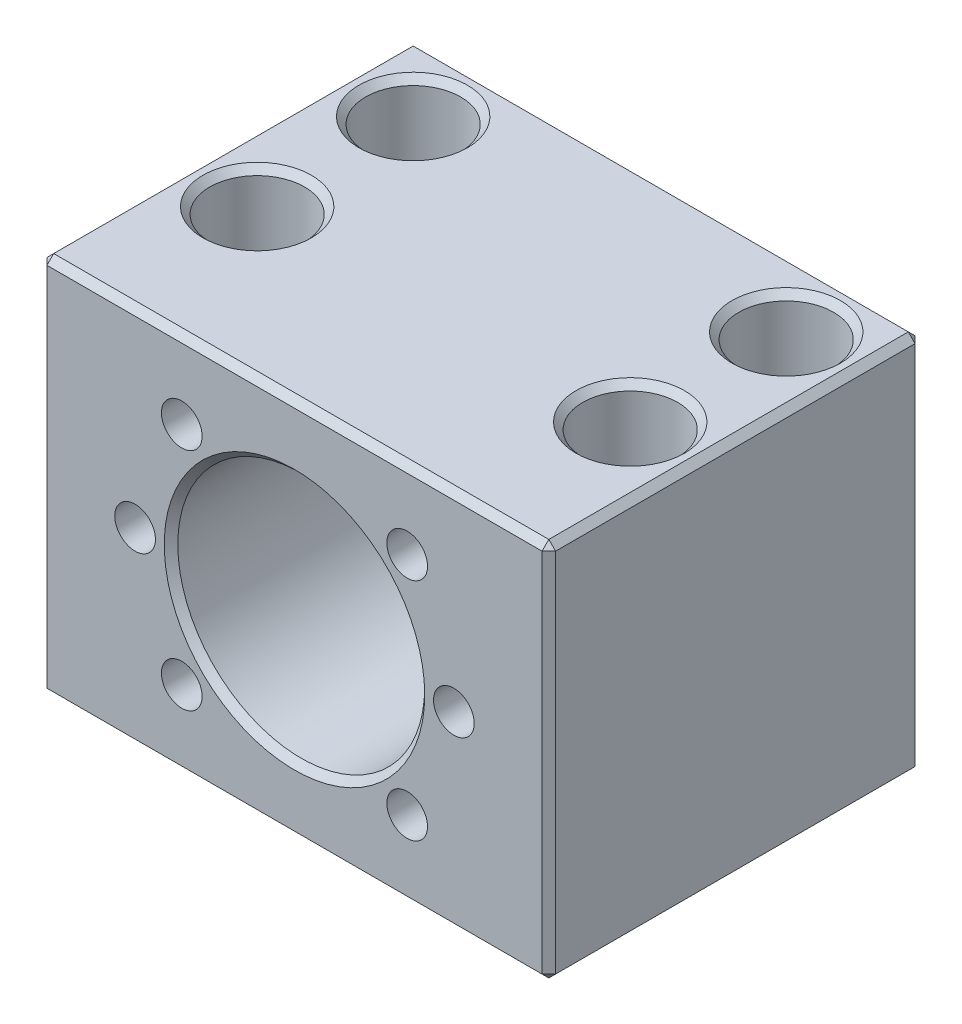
ISO-10303-21;
HEADER;
FILE_DESCRIPTION(('STEP AP214'),'2;1');
FILE_NAME('part.step','',(''),(''),'','','');
FILE_SCHEMA(('AUTOMOTIVE_DESIGN { 1 0 10303 214 1 1 1 1 }'));
ENDSEC;
DATA;
#1=APPLICATION_CONTEXT('core data for automotive mechanical design processes');
#2=APPLICATION_PROTOCOL_DEFINITION('international standard','automotive_design',2000,#1);
#3=PRODUCT_CONTEXT('',#1,'mechanical');
#4=PRODUCT('Part','Part','',(#3));
#5=PRODUCT_RELATED_PRODUCT_CATEGORY('part','',(#4));
#6=PRODUCT_DEFINITION_FORMATION('','',#4);
#7=PRODUCT_DEFINITION_CONTEXT('part definition',#1,'design');
#8=PRODUCT_DEFINITION('design','',#6,#7);
#9=PRODUCT_DEFINITION_SHAPE('','',#8);
#10=(LENGTH_UNIT() NAMED_UNIT(*) SI_UNIT(.MILLI.,.METRE.));
#11=(NAMED_UNIT(*) PLANE_ANGLE_UNIT() SI_UNIT($,.RADIAN.));
#12=(NAMED_UNIT(*) SI_UNIT($,.STERADIAN.) SOLID_ANGLE_UNIT());
#13=UNCERTAINTY_MEASURE_WITH_UNIT(LENGTH_MEASURE(1.E-05),#10,'distance_accuracy_value','');
#14=(GEOMETRIC_REPRESENTATION_CONTEXT(3) GLOBAL_UNCERTAINTY_ASSIGNED_CONTEXT((#13)) GLOBAL_UNIT_ASSIGNED_CONTEXT((#10,
#11,#12)) REPRESENTATION_CONTEXT('',''));
#15=CARTESIAN_POINT('',(0.,0.,0.));
#16=DIRECTION('',(0.,0.,1.));
#17=DIRECTION('',(1.,0.,0.));
#18=AXIS2_PLACEMENT_3D('',#15,#16,#17);
#19=CARTESIAN_POINT('',(-16.6170093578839,16.6170093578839,-11.));
#20=DIRECTION('',(0.,0.,1.));
#21=DIRECTION('',(1.,0.,0.));
#22=AXIS2_PLACEMENT_3D('',#19,#20,#21);
#23=PLANE('',#22);
#24=CARTESIAN_POINT('',(-16.6170093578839,16.6170093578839,-11.));
#25=DIRECTION('',(0.,0.,-1.));
#26=DIRECTION('',(1.,0.,0.));
#27=AXIS2_PLACEMENT_3D('',#24,#25,#26);
#28=CIRCLE('',#27,3.);
#29=CARTESIAN_POINT('',(-13.6170093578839,16.6170093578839,-11.));
#30=VERTEX_POINT('',#29);
#31=CARTESIAN_POINT('',(-19.6170093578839,16.6170093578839,-11.));
#32=VERTEX_POINT('',#31);
#33=EDGE_CURVE('E9',#30,#32,#28,.T.);
#34=ORIENTED_EDGE('',*,*,#33,.F.);
#35=CARTESIAN_POINT('',(-16.6170093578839,16.6170093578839,-11.));
#36=DIRECTION('',(0.,0.,-1.));
#37=DIRECTION('',(1.,0.,0.));
#38=AXIS2_PLACEMENT_3D('',#35,#36,#37);
#39=CIRCLE('',#38,3.);
#40=EDGE_CURVE('E24',#32,#30,#39,.T.);
#41=ORIENTED_EDGE('',*,*,#40,.F.);
#42=EDGE_LOOP('',(#34,#41));
#43=FACE_BOUND('',#42,.T.);
#44=ADVANCED_FACE('F15',(#43),#23,.T.);
#45=CARTESIAN_POINT('',(-16.6170093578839,16.6170093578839,0.));
#46=DIRECTION('',(0.,0.,-1.));
#47=DIRECTION('',(1.,0.,0.));
#48=AXIS2_PLACEMENT_3D('',#45,#46,#47);
#49=CYLINDRICAL_SURFACE('',#48,3.);
#50=CARTESIAN_POINT('',(-16.6170093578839,16.6170093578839,0.));
#51=DIRECTION('',(0.,0.,-1.));
#52=DIRECTION('',(1.,0.,0.));
#53=AXIS2_PLACEMENT_3D('',#50,#51,#52);
#54=CIRCLE('',#53,3.);
#55=CARTESIAN_POINT('',(-13.6170093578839,16.6170093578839,0.));
#56=VERTEX_POINT('',#55);
#57=CARTESIAN_POINT('',(-19.6170093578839,16.6170093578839,0.));
#58=VERTEX_POINT('',#57);
#59=EDGE_CURVE('E621',#56,#58,#54,.T.);
#60=ORIENTED_EDGE('',*,*,#59,.F.);
#61=CARTESIAN_POINT('',(-16.6170093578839,16.6170093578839,0.));
#62=DIRECTION('',(0.,0.,-1.));
#63=DIRECTION('',(1.,0.,0.));
#64=AXIS2_PLACEMENT_3D('',#61,#62,#63);
#65=CIRCLE('',#64,3.);
#66=EDGE_CURVE('E530',#58,#56,#65,.T.);
#67=ORIENTED_EDGE('',*,*,#66,.F.);
#68=DIRECTION('',(0.,0.,-1.));
#69=VECTOR('',#68,1.);
#70=CARTESIAN_POINT('',(-19.6170093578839,16.6170093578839,0.));
#71=LINE('',#70,#69);
#72=EDGE_CURVE('E747',#58,#32,#71,.T.);
#73=ORIENTED_EDGE('',*,*,#72,.T.);
#74=ORIENTED_EDGE('',*,*,#40,.T.);
#75=ORIENTED_EDGE('',*,*,#33,.T.);
#76=ORIENTED_EDGE('',*,*,#72,.F.);
#77=EDGE_LOOP('',(#60,#67,#73,#74,#75,#76));
#78=FACE_BOUND('',#77,.T.);
#79=ADVANCED_FACE('F17',(#78),#49,.F.);
#80=CARTESIAN_POINT('',(16.6170093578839,-16.6170093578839,-11.));
#81=DIRECTION('',(0.,0.,1.));
#82=DIRECTION('',(1.,0.,0.));
#83=AXIS2_PLACEMENT_3D('',#80,#81,#82);
#84=PLANE('',#83);
#85=CARTESIAN_POINT('',(16.6170093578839,-16.6170093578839,-11.));
#86=DIRECTION('',(0.,0.,-1.));
#87=DIRECTION('',(1.,0.,0.));
#88=AXIS2_PLACEMENT_3D('',#85,#86,#87);
#89=CIRCLE('',#88,3.);
#90=CARTESIAN_POINT('',(19.6170093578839,-16.6170093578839,-11.));
#91=VERTEX_POINT('',#90);
#92=CARTESIAN_POINT('',(13.6170093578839,-16.6170093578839,-11.));
#93=VERTEX_POINT('',#92);
#94=EDGE_CURVE('E750',#91,#93,#89,.T.);
#95=ORIENTED_EDGE('',*,*,#94,.F.);
#96=CARTESIAN_POINT('',(16.6170093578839,-16.6170093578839,-11.));
#97=DIRECTION('',(0.,0.,-1.));
#98=DIRECTION('',(1.,0.,0.));
#99=AXIS2_PLACEMENT_3D('',#96,#97,#98);
#100=CIRCLE('',#99,3.);
#101=EDGE_CURVE('E746',#93,#91,#100,.T.);
#102=ORIENTED_EDGE('',*,*,#101,.F.);
#103=EDGE_LOOP('',(#95,#102));
#104=FACE_BOUND('',#103,.T.);
#105=ADVANCED_FACE('F762',(#104),#84,.T.);
#106=CARTESIAN_POINT('',(16.6170093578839,-16.6170093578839,0.));
#107=DIRECTION('',(0.,0.,-1.));
#108=DIRECTION('',(1.,0.,0.));
#109=AXIS2_PLACEMENT_3D('',#106,#107,#108);
#110=CYLINDRICAL_SURFACE('',#109,3.);
#111=CARTESIAN_POINT('',(16.6170093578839,-16.6170093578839,0.));
#112=DIRECTION('',(0.,0.,-1.));
#113=DIRECTION('',(1.,0.,0.));
#114=AXIS2_PLACEMENT_3D('',#111,#112,#113);
#115=CIRCLE('',#114,3.);
#116=CARTESIAN_POINT('',(19.6170093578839,-16.6170093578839,0.));
#117=VERTEX_POINT('',#116);
#118=CARTESIAN_POINT('',(13.6170093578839,-16.6170093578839,0.));
#119=VERTEX_POINT('',#118);
#120=EDGE_CURVE('E611',#117,#119,#115,.T.);
#121=ORIENTED_EDGE('',*,*,#120,.F.);
#122=CARTESIAN_POINT('',(16.6170093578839,-16.6170093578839,0.));
#123=DIRECTION('',(0.,0.,-1.));
#124=DIRECTION('',(1.,0.,0.));
#125=AXIS2_PLACEMENT_3D('',#122,#123,#124);
#126=CIRCLE('',#125,3.);
#127=EDGE_CURVE('E618',#119,#117,#126,.T.);
#128=ORIENTED_EDGE('',*,*,#127,.F.);
#129=DIRECTION('',(0.,0.,-1.));
#130=VECTOR('',#129,1.);
#131=CARTESIAN_POINT('',(13.6170093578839,-16.6170093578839,0.));
#132=LINE('',#131,#130);
#133=EDGE_CURVE('E742',#119,#93,#132,.T.);
#134=ORIENTED_EDGE('',*,*,#133,.T.);
#135=ORIENTED_EDGE('',*,*,#101,.T.);
#136=ORIENTED_EDGE('',*,*,#94,.T.);
#137=ORIENTED_EDGE('',*,*,#133,.F.);
#138=EDGE_LOOP('',(#121,#128,#134,#135,#136,#137));
#139=FACE_BOUND('',#138,.T.);
#140=ADVANCED_FACE('F955',(#139),#110,.F.);
#141=CARTESIAN_POINT('',(23.5,0.,-11.));
#142=DIRECTION('',(0.,0.,1.));
#143=DIRECTION('',(1.,0.,0.));
#144=AXIS2_PLACEMENT_3D('',#141,#142,#143);
#145=PLANE('',#144);
#146=CARTESIAN_POINT('',(23.5,0.,-11.));
#147=DIRECTION('',(0.,0.,-1.));
#148=DIRECTION('',(1.,0.,0.));
#149=AXIS2_PLACEMENT_3D('',#146,#147,#148);
#150=CIRCLE('',#149,3.);
#151=CARTESIAN_POINT('',(26.5,0.,-11.));
#152=VERTEX_POINT('',#151);
#153=CARTESIAN_POINT('',(20.5,0.,-11.));
#154=VERTEX_POINT('',#153);
#155=EDGE_CURVE('E739',#152,#154,#150,.T.);
#156=ORIENTED_EDGE('',*,*,#155,.F.);
#157=CARTESIAN_POINT('',(23.5,0.,-11.));
#158=DIRECTION('',(0.,0.,-1.));
#159=DIRECTION('',(1.,0.,0.));
#160=AXIS2_PLACEMENT_3D('',#157,#158,#159);
#161=CIRCLE('',#160,3.);
#162=EDGE_CURVE('E735',#154,#152,#161,.T.);
#163=ORIENTED_EDGE('',*,*,#162,.F.);
#164=EDGE_LOOP('',(#156,#163));
#165=FACE_BOUND('',#164,.T.);
#166=ADVANCED_FACE('F824',(#165),#145,.T.);
#167=CARTESIAN_POINT('',(23.5,0.,0.));
#168=DIRECTION('',(0.,0.,-1.));
#169=DIRECTION('',(1.,0.,0.));
#170=AXIS2_PLACEMENT_3D('',#167,#168,#169);
#171=CYLINDRICAL_SURFACE('',#170,3.);
#172=CARTESIAN_POINT('',(23.5,0.,0.));
#173=DIRECTION('',(0.,0.,-1.));
#174=DIRECTION('',(1.,0.,0.));
#175=AXIS2_PLACEMENT_3D('',#172,#173,#174);
#176=CIRCLE('',#175,3.);
#177=CARTESIAN_POINT('',(26.5,0.,0.));
#178=VERTEX_POINT('',#177);
#179=CARTESIAN_POINT('',(20.5,0.,0.));
#180=VERTEX_POINT('',#179);
#181=EDGE_CURVE('E547',#178,#180,#176,.T.);
#182=ORIENTED_EDGE('',*,*,#181,.F.);
#183=CARTESIAN_POINT('',(23.5,0.,0.));
#184=DIRECTION('',(0.,0.,-1.));
#185=DIRECTION('',(1.,0.,0.));
#186=AXIS2_PLACEMENT_3D('',#183,#184,#185);
#187=CIRCLE('',#186,3.);
#188=EDGE_CURVE('E551',#180,#178,#187,.T.);
#189=ORIENTED_EDGE('',*,*,#188,.F.);
#190=DIRECTION('',(0.,0.,-1.));
#191=VECTOR('',#190,1.);
#192=CARTESIAN_POINT('',(20.5,0.,0.));
#193=LINE('',#192,#191);
#194=EDGE_CURVE('E731',#180,#154,#193,.T.);
#195=ORIENTED_EDGE('',*,*,#194,.T.);
#196=ORIENTED_EDGE('',*,*,#162,.T.);
#197=ORIENTED_EDGE('',*,*,#155,.T.);
#198=ORIENTED_EDGE('',*,*,#194,.F.);
#199=EDGE_LOOP('',(#182,#189,#195,#196,#197,#198));
#200=FACE_BOUND('',#199,.T.);
#201=ADVANCED_FACE('F820',(#200),#171,.F.);
#202=CARTESIAN_POINT('',(-23.5,0.,-11.));
#203=DIRECTION('',(0.,0.,1.));
#204=DIRECTION('',(1.,0.,0.));
#205=AXIS2_PLACEMENT_3D('',#202,#203,#204);
#206=PLANE('',#205);
#207=CARTESIAN_POINT('',(-23.5,0.,-11.));
#208=DIRECTION('',(0.,0.,-1.));
#209=DIRECTION('',(1.,0.,0.));
#210=AXIS2_PLACEMENT_3D('',#207,#208,#209);
#211=CIRCLE('',#210,3.);
#212=CARTESIAN_POINT('',(-20.5,0.,-11.));
#213=VERTEX_POINT('',#212);
#214=CARTESIAN_POINT('',(-26.5,0.,-11.));
#215=VERTEX_POINT('',#214);
#216=EDGE_CURVE('E635',#213,#215,#211,.T.);
#217=ORIENTED_EDGE('',*,*,#216,.F.);
#218=CARTESIAN_POINT('',(-23.5,0.,-11.));
#219=DIRECTION('',(0.,0.,-1.));
#220=DIRECTION('',(1.,0.,0.));
#221=AXIS2_PLACEMENT_3D('',#218,#219,#220);
#222=CIRCLE('',#221,3.);
#223=EDGE_CURVE('E631',#215,#213,#222,.T.);
#224=ORIENTED_EDGE('',*,*,#223,.F.);
#225=EDGE_LOOP('',(#217,#224));
#226=FACE_BOUND('',#225,.T.);
#227=ADVANCED_FACE('F823',(#226),#206,.T.);
#228=CARTESIAN_POINT('',(-23.5,0.,0.));
#229=DIRECTION('',(0.,0.,-1.));
#230=DIRECTION('',(1.,0.,0.));
#231=AXIS2_PLACEMENT_3D('',#228,#229,#230);
#232=CYLINDRICAL_SURFACE('',#231,3.);
#233=CARTESIAN_POINT('',(-23.5,0.,0.));
#234=DIRECTION('',(0.,0.,-1.));
#235=DIRECTION('',(1.,0.,0.));
#236=AXIS2_PLACEMENT_3D('',#233,#234,#235);
#237=CIRCLE('',#236,3.);
#238=CARTESIAN_POINT('',(-20.5,0.,0.));
#239=VERTEX_POINT('',#238);
#240=CARTESIAN_POINT('',(-26.5,0.,0.));
#241=VERTEX_POINT('',#240);
#242=EDGE_CURVE('E597',#239,#241,#237,.T.);
#243=ORIENTED_EDGE('',*,*,#242,.F.);
#244=CARTESIAN_POINT('',(-23.5,0.,0.));
#245=DIRECTION('',(0.,0.,-1.));
#246=DIRECTION('',(1.,0.,0.));
#247=AXIS2_PLACEMENT_3D('',#244,#245,#246);
#248=CIRCLE('',#247,3.);
#249=EDGE_CURVE('E552',#241,#239,#248,.T.);
#250=ORIENTED_EDGE('',*,*,#249,.F.);
#251=DIRECTION('',(0.,0.,-1.));
#252=VECTOR('',#251,1.);
#253=CARTESIAN_POINT('',(-26.5,0.,0.));
#254=LINE('',#253,#252);
#255=EDGE_CURVE('E636',#241,#215,#254,.T.);
#256=ORIENTED_EDGE('',*,*,#255,.T.);
#257=ORIENTED_EDGE('',*,*,#223,.T.);
#258=ORIENTED_EDGE('',*,*,#216,.T.);
#259=ORIENTED_EDGE('',*,*,#255,.F.);
#260=EDGE_LOOP('',(#243,#250,#256,#257,#258,#259));
#261=FACE_BOUND('',#260,.T.);
#262=ADVANCED_FACE('F945',(#261),#232,.F.);
#263=CARTESIAN_POINT('',(-16.6170093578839,-16.6170093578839,-11.));
#264=DIRECTION('',(0.,0.,1.));
#265=DIRECTION('',(1.,0.,0.));
#266=AXIS2_PLACEMENT_3D('',#263,#264,#265);
#267=PLANE('',#266);
#268=CARTESIAN_POINT('',(-16.6170093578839,-16.6170093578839,-11.));
#269=DIRECTION('',(0.,0.,-1.));
#270=DIRECTION('',(1.,0.,0.));
#271=AXIS2_PLACEMENT_3D('',#268,#269,#270);
#272=CIRCLE('',#271,3.);
#273=CARTESIAN_POINT('',(-13.6170093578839,-16.6170093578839,-11.));
#274=VERTEX_POINT('',#273);
#275=CARTESIAN_POINT('',(-19.6170093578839,-16.6170093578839,-11.));
#276=VERTEX_POINT('',#275);
#277=EDGE_CURVE('E723',#274,#276,#272,.T.);
#278=ORIENTED_EDGE('',*,*,#277,.F.);
#279=CARTESIAN_POINT('',(-16.6170093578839,-16.6170093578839,-11.));
#280=DIRECTION('',(0.,0.,-1.));
#281=DIRECTION('',(1.,0.,0.));
#282=AXIS2_PLACEMENT_3D('',#279,#280,#281);
#283=CIRCLE('',#282,3.);
#284=EDGE_CURVE('E719',#276,#274,#283,.T.);
#285=ORIENTED_EDGE('',*,*,#284,.F.);
#286=EDGE_LOOP('',(#278,#285));
#287=FACE_BOUND('',#286,.T.);
#288=ADVANCED_FACE('F941',(#287),#267,.T.);
#289=CARTESIAN_POINT('',(-16.6170093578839,-16.6170093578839,0.));
#290=DIRECTION('',(0.,0.,-1.));
#291=DIRECTION('',(1.,0.,0.));
#292=AXIS2_PLACEMENT_3D('',#289,#290,#291);
#293=CYLINDRICAL_SURFACE('',#292,3.);
#294=CARTESIAN_POINT('',(-16.6170093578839,-16.6170093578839,0.));
#295=DIRECTION('',(0.,0.,-1.));
#296=DIRECTION('',(1.,0.,0.));
#297=AXIS2_PLACEMENT_3D('',#294,#295,#296);
#298=CIRCLE('',#297,3.);
#299=CARTESIAN_POINT('',(-13.6170093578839,-16.6170093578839,0.));
#300=VERTEX_POINT('',#299);
#301=CARTESIAN_POINT('',(-19.6170093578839,-16.6170093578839,0.));
#302=VERTEX_POINT('',#301);
#303=EDGE_CURVE('E515',#300,#302,#298,.T.);
#304=ORIENTED_EDGE('',*,*,#303,.F.);
#305=CARTESIAN_POINT('',(-16.6170093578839,-16.6170093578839,0.));
#306=DIRECTION('',(0.,0.,-1.));
#307=DIRECTION('',(1.,0.,0.));
#308=AXIS2_PLACEMENT_3D('',#305,#306,#307);
#309=CIRCLE('',#308,3.);
#310=EDGE_CURVE('E519',#302,#300,#309,.T.);
#311=ORIENTED_EDGE('',*,*,#310,.F.);
#312=DIRECTION('',(0.,0.,-1.));
#313=VECTOR('',#312,1.);
#314=CARTESIAN_POINT('',(-19.6170093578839,-16.6170093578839,0.));
#315=LINE('',#314,#313);
#316=EDGE_CURVE('E715',#302,#276,#315,.T.);
#317=ORIENTED_EDGE('',*,*,#316,.T.);
#318=ORIENTED_EDGE('',*,*,#284,.T.);
#319=ORIENTED_EDGE('',*,*,#277,.T.);
#320=ORIENTED_EDGE('',*,*,#316,.F.);
#321=EDGE_LOOP('',(#304,#311,#317,#318,#319,#320));
#322=FACE_BOUND('',#321,.T.);
#323=ADVANCED_FACE('F937',(#322),#293,.F.);
#324=CARTESIAN_POINT('',(16.6170093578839,16.6170093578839,-11.));
#325=DIRECTION('',(0.,0.,1.));
#326=DIRECTION('',(1.,0.,0.));
#327=AXIS2_PLACEMENT_3D('',#324,#325,#326);
#328=PLANE('',#327);
#329=CARTESIAN_POINT('',(16.6170093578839,16.6170093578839,-11.));
#330=DIRECTION('',(0.,0.,-1.));
#331=DIRECTION('',(1.,0.,0.));
#332=AXIS2_PLACEMENT_3D('',#329,#330,#331);
#333=CIRCLE('',#332,3.);
#334=CARTESIAN_POINT('',(19.6170093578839,16.6170093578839,-11.));
#335=VERTEX_POINT('',#334);
#336=CARTESIAN_POINT('',(13.6170093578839,16.6170093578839,-11.));
#337=VERTEX_POINT('',#336);
#338=EDGE_CURVE('E712',#335,#337,#333,.T.);
#339=ORIENTED_EDGE('',*,*,#338,.F.);
#340=CARTESIAN_POINT('',(16.6170093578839,16.6170093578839,-11.));
#341=DIRECTION('',(0.,0.,-1.));
#342=DIRECTION('',(1.,0.,0.));
#343=AXIS2_PLACEMENT_3D('',#340,#341,#342);
#344=CIRCLE('',#343,3.);
#345=EDGE_CURVE('E708',#337,#335,#344,.T.);
#346=ORIENTED_EDGE('',*,*,#345,.F.);
#347=EDGE_LOOP('',(#339,#346));
#348=FACE_BOUND('',#347,.T.);
#349=ADVANCED_FACE('F940',(#348),#328,.T.);
#350=CARTESIAN_POINT('',(16.6170093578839,16.6170093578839,0.));
#351=DIRECTION('',(0.,0.,-1.));
#352=DIRECTION('',(1.,0.,0.));
#353=AXIS2_PLACEMENT_3D('',#350,#351,#352);
#354=CYLINDRICAL_SURFACE('',#353,3.);
#355=CARTESIAN_POINT('',(16.6170093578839,16.6170093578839,0.));
#356=DIRECTION('',(0.,0.,-1.));
#357=DIRECTION('',(1.,0.,0.));
#358=AXIS2_PLACEMENT_3D('',#355,#356,#357);
#359=CIRCLE('',#358,3.);
#360=CARTESIAN_POINT('',(19.6170093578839,16.6170093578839,0.));
#361=VERTEX_POINT('',#360);
#362=CARTESIAN_POINT('',(13.6170093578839,16.6170093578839,0.));
#363=VERTEX_POINT('',#362);
#364=EDGE_CURVE('E508',#361,#363,#359,.T.);
#365=ORIENTED_EDGE('',*,*,#364,.F.);
#366=CARTESIAN_POINT('',(16.6170093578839,16.6170093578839,0.));
#367=DIRECTION('',(0.,0.,-1.));
#368=DIRECTION('',(1.,0.,0.));
#369=AXIS2_PLACEMENT_3D('',#366,#367,#368);
#370=CIRCLE('',#369,3.);
#371=EDGE_CURVE('E520',#363,#361,#370,.T.);
#372=ORIENTED_EDGE('',*,*,#371,.F.);
#373=DIRECTION('',(0.,0.,-1.));
#374=VECTOR('',#373,1.);
#375=CARTESIAN_POINT('',(13.6170093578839,16.6170093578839,0.));
#376=LINE('',#375,#374);
#377=EDGE_CURVE('E704',#363,#337,#376,.T.);
#378=ORIENTED_EDGE('',*,*,#377,.T.);
#379=ORIENTED_EDGE('',*,*,#345,.T.);
#380=ORIENTED_EDGE('',*,*,#338,.T.);
#381=ORIENTED_EDGE('',*,*,#377,.F.);
#382=EDGE_LOOP('',(#365,#372,#378,#379,#380,#381));
#383=FACE_BOUND('',#382,.T.);
#384=ADVANCED_FACE('F867',(#383),#354,.F.);
#385=CARTESIAN_POINT('',(-27.5,28.,-45.));
#386=DIRECTION('',(0.,-1.,0.));
#387=DIRECTION('',(1.,0.,0.));
#388=AXIS2_PLACEMENT_3D('',#385,#386,#387);
#389=CYLINDRICAL_SURFACE('',#388,4.2);
#390=CARTESIAN_POINT('',(-27.5,17.,-45.));
#391=DIRECTION('',(0.,1.,0.));
#392=DIRECTION('',(1.,0.,0.));
#393=AXIS2_PLACEMENT_3D('',#390,#391,#392);
#394=CIRCLE('',#393,4.2);
#395=CARTESIAN_POINT('',(-23.3,17.,-45.));
#396=VERTEX_POINT('',#395);
#397=CARTESIAN_POINT('',(-31.7,17.,-45.));
#398=VERTEX_POINT('',#397);
#399=EDGE_CURVE('E676',#396,#398,#394,.T.);
#400=ORIENTED_EDGE('',*,*,#399,.T.);
#401=DIRECTION('',(0.,-1.,0.));
#402=VECTOR('',#401,1.);
#403=CARTESIAN_POINT('',(-31.7,28.,-45.));
#404=LINE('',#403,#402);
#405=CARTESIAN_POINT('',(-31.7,-13.,-45.));
#406=VERTEX_POINT('',#405);
#407=EDGE_CURVE('E701',#398,#406,#404,.T.);
#408=ORIENTED_EDGE('',*,*,#407,.T.);
#409=CARTESIAN_POINT('',(-27.5,-13.,-45.));
#410=DIRECTION('',(0.,-1.,0.));
#411=DIRECTION('',(1.,0.,0.));
#412=AXIS2_PLACEMENT_3D('',#409,#410,#411);
#413=CIRCLE('',#412,4.2);
#414=EDGE_CURVE('E580',#406,#406,#413,.T.);
#415=ORIENTED_EDGE('',*,*,#414,.T.);
#416=ORIENTED_EDGE('',*,*,#407,.F.);
#417=CARTESIAN_POINT('',(-27.5,17.,-45.));
#418=DIRECTION('',(0.,1.,0.));
#419=DIRECTION('',(1.,0.,0.));
#420=AXIS2_PLACEMENT_3D('',#417,#418,#419);
#421=CIRCLE('',#420,4.2);
#422=EDGE_CURVE('E696',#398,#396,#421,.T.);
#423=ORIENTED_EDGE('',*,*,#422,.T.);
#424=EDGE_LOOP('',(#400,#408,#415,#416,#423));
#425=FACE_BOUND('',#424,.T.);
#426=ADVANCED_FACE('F863',(#425),#389,.F.);
#427=CARTESIAN_POINT('',(27.5,28.,-22.));
#428=DIRECTION('',(0.,-1.,0.));
#429=DIRECTION('',(1.,0.,0.));
#430=AXIS2_PLACEMENT_3D('',#427,#428,#429);
#431=CYLINDRICAL_SURFACE('',#430,4.2);
#432=CARTESIAN_POINT('',(27.5,17.,-22.));
#433=DIRECTION('',(0.,1.,0.));
#434=DIRECTION('',(1.,0.,0.));
#435=AXIS2_PLACEMENT_3D('',#432,#433,#434);
#436=CIRCLE('',#435,4.2);
#437=CARTESIAN_POINT('',(23.3,17.,-22.));
#438=VERTEX_POINT('',#437);
#439=EDGE_CURVE('E598',#438,#438,#436,.T.);
#440=ORIENTED_EDGE('',*,*,#439,.T.);
#441=DIRECTION('',(0.,-1.,0.));
#442=VECTOR('',#441,1.);
#443=CARTESIAN_POINT('',(23.3,28.,-22.));
#444=LINE('',#443,#442);
#445=CARTESIAN_POINT('',(23.3,-13.,-22.));
#446=VERTEX_POINT('',#445);
#447=EDGE_CURVE('E689',#438,#446,#444,.T.);
#448=ORIENTED_EDGE('',*,*,#447,.T.);
#449=CARTESIAN_POINT('',(27.5,-13.,-22.));
#450=DIRECTION('',(0.,-1.,0.));
#451=DIRECTION('',(1.,0.,0.));
#452=AXIS2_PLACEMENT_3D('',#449,#450,#451);
#453=CIRCLE('',#452,4.2);
#454=EDGE_CURVE('E480',#446,#446,#453,.T.);
#455=ORIENTED_EDGE('',*,*,#454,.T.);
#456=ORIENTED_EDGE('',*,*,#447,.F.);
#457=EDGE_LOOP('',(#440,#448,#455,#456));
#458=FACE_BOUND('',#457,.T.);
#459=ADVANCED_FACE('F866',(#458),#431,.F.);
#460=CARTESIAN_POINT('',(27.5,28.,-45.));
#461=DIRECTION('',(0.,-1.,0.));
#462=DIRECTION('',(1.,0.,0.));
#463=AXIS2_PLACEMENT_3D('',#460,#461,#462);
#464=CYLINDRICAL_SURFACE('',#463,4.2);
#465=CARTESIAN_POINT('',(27.5,17.,-45.));
#466=DIRECTION('',(0.,1.,0.));
#467=DIRECTION('',(1.,0.,0.));
#468=AXIS2_PLACEMENT_3D('',#465,#466,#467);
#469=CIRCLE('',#468,4.2);
#470=CARTESIAN_POINT('',(23.3,17.,-45.));
#471=VERTEX_POINT('',#470);
#472=EDGE_CURVE('E602',#471,#471,#469,.T.);
#473=ORIENTED_EDGE('',*,*,#472,.T.);
#474=DIRECTION('',(0.,-1.,0.));
#475=VECTOR('',#474,1.);
#476=CARTESIAN_POINT('',(23.3,28.,-45.));
#477=LINE('',#476,#475);
#478=CARTESIAN_POINT('',(23.3,-13.,-45.));
#479=VERTEX_POINT('',#478);
#480=EDGE_CURVE('E686',#471,#479,#477,.T.);
#481=ORIENTED_EDGE('',*,*,#480,.T.);
#482=CARTESIAN_POINT('',(27.5,-13.,-45.));
#483=DIRECTION('',(0.,-1.,0.));
#484=DIRECTION('',(1.,0.,0.));
#485=AXIS2_PLACEMENT_3D('',#482,#483,#484);
#486=CIRCLE('',#485,4.2);
#487=EDGE_CURVE('E614',#479,#479,#486,.T.);
#488=ORIENTED_EDGE('',*,*,#487,.T.);
#489=ORIENTED_EDGE('',*,*,#480,.F.);
#490=EDGE_LOOP('',(#473,#481,#488,#489));
#491=FACE_BOUND('',#490,.T.);
#492=ADVANCED_FACE('F929',(#491),#464,.F.);
#493=CARTESIAN_POINT('',(-27.5,28.,-22.));
#494=DIRECTION('',(0.,-1.,0.));
#495=DIRECTION('',(1.,0.,0.));
#496=AXIS2_PLACEMENT_3D('',#493,#494,#495);
#497=CYLINDRICAL_SURFACE('',#496,4.2);
#498=CARTESIAN_POINT('',(-27.5,17.,-22.));
#499=DIRECTION('',(0.,1.,0.));
#500=DIRECTION('',(1.,0.,0.));
#501=AXIS2_PLACEMENT_3D('',#498,#499,#500);
#502=CIRCLE('',#501,4.2);
#503=CARTESIAN_POINT('',(-23.3,17.,-22.));
#504=VERTEX_POINT('',#503);
#505=CARTESIAN_POINT('',(-31.7,17.,-22.));
#506=VERTEX_POINT('',#505);
#507=EDGE_CURVE('E677',#504,#506,#502,.T.);
#508=ORIENTED_EDGE('',*,*,#507,.T.);
#509=DIRECTION('',(0.,-1.,0.));
#510=VECTOR('',#509,1.);
#511=CARTESIAN_POINT('',(-31.7,28.,-22.));
#512=LINE('',#511,#510);
#513=CARTESIAN_POINT('',(-31.7,-13.,-22.));
#514=VERTEX_POINT('',#513);
#515=EDGE_CURVE('E690',#506,#514,#512,.T.);
#516=ORIENTED_EDGE('',*,*,#515,.T.);
#517=CARTESIAN_POINT('',(-27.5,-13.,-22.));
#518=DIRECTION('',(0.,-1.,0.));
#519=DIRECTION('',(1.,0.,0.));
#520=AXIS2_PLACEMENT_3D('',#517,#518,#519);
#521=CIRCLE('',#520,4.2);
#522=EDGE_CURVE('E603',#514,#514,#521,.T.);
#523=ORIENTED_EDGE('',*,*,#522,.T.);
#524=ORIENTED_EDGE('',*,*,#515,.F.);
#525=CARTESIAN_POINT('',(-27.5,17.,-22.));
#526=DIRECTION('',(0.,1.,0.));
#527=DIRECTION('',(1.,0.,0.));
#528=AXIS2_PLACEMENT_3D('',#525,#526,#527);
#529=CIRCLE('',#528,4.2);
#530=EDGE_CURVE('E673',#506,#504,#529,.T.);
#531=ORIENTED_EDGE('',*,*,#530,.T.);
#532=EDGE_LOOP('',(#508,#516,#523,#524,#531));
#533=FACE_BOUND('',#532,.T.);
#534=ADVANCED_FACE('F926',(#533),#497,.F.);
#535=CARTESIAN_POINT('',(-27.5,17.,-45.));
#536=DIRECTION('',(0.,1.,0.));
#537=DIRECTION('',(1.,0.,0.));
#538=AXIS2_PLACEMENT_3D('',#535,#536,#537);
#539=PLANE('',#538);
#540=ORIENTED_EDGE('',*,*,#399,.F.);
#541=ORIENTED_EDGE('',*,*,#422,.F.);
#542=EDGE_LOOP('',(#540,#541));
#543=FACE_BOUND('',#542,.T.);
#544=CARTESIAN_POINT('',(-27.5,17.,-45.));
#545=DIRECTION('',(0.,-1.,0.));
#546=DIRECTION('',(1.,0.,0.));
#547=AXIS2_PLACEMENT_3D('',#544,#545,#546);
#548=CIRCLE('',#547,7.);
#549=CARTESIAN_POINT('',(-20.5,17.,-45.));
#550=VERTEX_POINT('',#549);
#551=CARTESIAN_POINT('',(-34.5,17.,-45.));
#552=VERTEX_POINT('',#551);
#553=EDGE_CURVE('E1065',#550,#552,#548,.T.);
#554=ORIENTED_EDGE('',*,*,#553,.F.);
#555=CARTESIAN_POINT('',(-27.5,17.,-45.));
#556=DIRECTION('',(0.,-1.,0.));
#557=DIRECTION('',(1.,0.,0.));
#558=AXIS2_PLACEMENT_3D('',#555,#556,#557);
#559=CIRCLE('',#558,7.);
#560=EDGE_CURVE('E1061',#552,#550,#559,.T.);
#561=ORIENTED_EDGE('',*,*,#560,.F.);
#562=EDGE_LOOP('',(#554,#561));
#563=FACE_BOUND('',#562,.T.);
#564=ADVANCED_FACE('F924',(#543,#563),#539,.T.);
#565=CARTESIAN_POINT('',(-27.5,17.,-22.));
#566=DIRECTION('',(0.,1.,0.));
#567=DIRECTION('',(1.,0.,0.));
#568=AXIS2_PLACEMENT_3D('',#565,#566,#567);
#569=PLANE('',#568);
#570=ORIENTED_EDGE('',*,*,#507,.F.);
#571=ORIENTED_EDGE('',*,*,#530,.F.);
#572=EDGE_LOOP('',(#570,#571));
#573=FACE_BOUND('',#572,.T.);
#574=CARTESIAN_POINT('',(-27.5,17.,-22.));
#575=DIRECTION('',(0.,-1.,0.));
#576=DIRECTION('',(1.,0.,0.));
#577=AXIS2_PLACEMENT_3D('',#574,#575,#576);
#578=CIRCLE('',#577,7.);
#579=CARTESIAN_POINT('',(-20.5,17.,-22.));
#580=VERTEX_POINT('',#579);
#581=CARTESIAN_POINT('',(-34.5,17.,-22.));
#582=VERTEX_POINT('',#581);
#583=EDGE_CURVE('E1006',#580,#582,#578,.T.);
#584=ORIENTED_EDGE('',*,*,#583,.F.);
#585=CARTESIAN_POINT('',(-27.5,17.,-22.));
#586=DIRECTION('',(0.,-1.,0.));
#587=DIRECTION('',(1.,0.,0.));
#588=AXIS2_PLACEMENT_3D('',#585,#586,#587);
#589=CIRCLE('',#588,7.);
#590=EDGE_CURVE('E1002',#582,#580,#589,.T.);
#591=ORIENTED_EDGE('',*,*,#590,.F.);
#592=EDGE_LOOP('',(#584,#591));
#593=FACE_BOUND('',#592,.T.);
#594=ADVANCED_FACE('F920',(#573,#593),#569,.T.);
#595=CARTESIAN_POINT('',(27.5,17.,-45.));
#596=DIRECTION('',(0.,1.,0.));
#597=DIRECTION('',(1.,0.,0.));
#598=AXIS2_PLACEMENT_3D('',#595,#596,#597);
#599=PLANE('',#598);
#600=ORIENTED_EDGE('',*,*,#472,.F.);
#601=EDGE_LOOP('',(#600));
#602=FACE_BOUND('',#601,.T.);
#603=CARTESIAN_POINT('',(27.5,17.,-45.));
#604=DIRECTION('',(0.,-1.,0.));
#605=DIRECTION('',(1.,0.,0.));
#606=AXIS2_PLACEMENT_3D('',#603,#604,#605);
#607=CIRCLE('',#606,7.);
#608=CARTESIAN_POINT('',(34.5,17.,-45.));
#609=VERTEX_POINT('',#608);
#610=CARTESIAN_POINT('',(20.5,17.,-45.));
#611=VERTEX_POINT('',#610);
#612=EDGE_CURVE('E1050',#609,#611,#607,.T.);
#613=ORIENTED_EDGE('',*,*,#612,.F.);
#614=CARTESIAN_POINT('',(27.5,17.,-45.));
#615=DIRECTION('',(0.,-1.,0.));
#616=DIRECTION('',(1.,0.,0.));
#617=AXIS2_PLACEMENT_3D('',#614,#615,#616);
#618=CIRCLE('',#617,7.);
#619=EDGE_CURVE('E1015',#611,#609,#618,.T.);
#620=ORIENTED_EDGE('',*,*,#619,.F.);
#621=EDGE_LOOP('',(#613,#620));
#622=FACE_BOUND('',#621,.T.);
#623=ADVANCED_FACE('F916',(#602,#622),#599,.T.);
#624=CARTESIAN_POINT('',(27.5,17.,-22.));
#625=DIRECTION('',(0.,1.,0.));
#626=DIRECTION('',(1.,0.,0.));
#627=AXIS2_PLACEMENT_3D('',#624,#625,#626);
#628=PLANE('',#627);
#629=ORIENTED_EDGE('',*,*,#439,.F.);
#630=EDGE_LOOP('',(#629));
#631=FACE_BOUND('',#630,.T.);
#632=CARTESIAN_POINT('',(27.5,17.,-22.));
#633=DIRECTION('',(0.,-1.,0.));
#634=DIRECTION('',(1.,0.,0.));
#635=AXIS2_PLACEMENT_3D('',#632,#633,#634);
#636=CIRCLE('',#635,7.);
#637=CARTESIAN_POINT('',(34.5,17.,-22.));
#638=VERTEX_POINT('',#637);
#639=CARTESIAN_POINT('',(20.5,17.,-22.));
#640=VERTEX_POINT('',#639);
#641=EDGE_CURVE('E1120',#638,#640,#636,.T.);
#642=ORIENTED_EDGE('',*,*,#641,.F.);
#643=CARTESIAN_POINT('',(27.5,17.,-22.));
#644=DIRECTION('',(0.,-1.,0.));
#645=DIRECTION('',(1.,0.,0.));
#646=AXIS2_PLACEMENT_3D('',#643,#644,#645);
#647=CIRCLE('',#646,7.);
#648=EDGE_CURVE('E1116',#640,#638,#647,.T.);
#649=ORIENTED_EDGE('',*,*,#648,.F.);
#650=EDGE_LOOP('',(#642,#649));
#651=FACE_BOUND('',#650,.T.);
#652=ADVANCED_FACE('F808',(#631,#651),#628,.T.);
#653=CARTESIAN_POINT('',(-27.5,-13.,-22.));
#654=DIRECTION('',(0.,-1.,0.));
#655=DIRECTION('',(0.,0.,-1.));
#656=AXIS2_PLACEMENT_3D('',#653,#654,#655);
#657=PLANE('',#656);
#658=ORIENTED_EDGE('',*,*,#522,.F.);
#659=EDGE_LOOP('',(#658));
#660=FACE_BOUND('',#659,.T.);
#661=CARTESIAN_POINT('',(-27.5,-13.,-22.));
#662=DIRECTION('',(0.,1.,0.));
#663=DIRECTION('',(1.,0.,0.));
#664=AXIS2_PLACEMENT_3D('',#661,#662,#663);
#665=CIRCLE('',#664,5.);
#666=CARTESIAN_POINT('',(-22.5,-13.,-22.));
#667=VERTEX_POINT('',#666);
#668=CARTESIAN_POINT('',(-32.5,-13.,-22.));
#669=VERTEX_POINT('',#668);
#670=EDGE_CURVE('E685',#667,#669,#665,.T.);
#671=ORIENTED_EDGE('',*,*,#670,.F.);
#672=CARTESIAN_POINT('',(-27.5,-13.,-22.));
#673=DIRECTION('',(0.,1.,0.));
#674=DIRECTION('',(1.,0.,0.));
#675=AXIS2_PLACEMENT_3D('',#672,#673,#674);
#676=CIRCLE('',#675,5.);
#677=EDGE_CURVE('E681',#669,#667,#676,.T.);
#678=ORIENTED_EDGE('',*,*,#677,.F.);
#679=EDGE_LOOP('',(#671,#678));
#680=FACE_BOUND('',#679,.T.);
#681=ADVANCED_FACE('F782',(#660,#680),#657,.T.);
#682=CARTESIAN_POINT('',(-27.5,-28.,-22.));
#683=DIRECTION('',(0.,1.,0.));
#684=DIRECTION('',(1.,0.,0.));
#685=AXIS2_PLACEMENT_3D('',#682,#683,#684);
#686=CYLINDRICAL_SURFACE('',#685,5.);
#687=CARTESIAN_POINT('',(-27.5,-28.,-22.));
#688=DIRECTION('',(0.,1.,0.));
#689=DIRECTION('',(1.,0.,0.));
#690=AXIS2_PLACEMENT_3D('',#687,#688,#689);
#691=CIRCLE('',#690,5.);
#692=CARTESIAN_POINT('',(-22.5,-28.,-22.));
#693=VERTEX_POINT('',#692);
#694=CARTESIAN_POINT('',(-32.5,-28.,-22.));
#695=VERTEX_POINT('',#694);
#696=EDGE_CURVE('E525',#693,#695,#691,.T.);
#697=ORIENTED_EDGE('',*,*,#696,.F.);
#698=CARTESIAN_POINT('',(-27.5,-28.,-22.));
#699=DIRECTION('',(0.,1.,0.));
#700=DIRECTION('',(1.,0.,0.));
#701=AXIS2_PLACEMENT_3D('',#698,#699,#700);
#702=CIRCLE('',#701,5.);
#703=EDGE_CURVE('E529',#695,#693,#702,.T.);
#704=ORIENTED_EDGE('',*,*,#703,.F.);
#705=DIRECTION('',(0.,1.,0.));
#706=VECTOR('',#705,1.);
#707=CARTESIAN_POINT('',(-32.5,-28.,-22.));
#708=LINE('',#707,#706);
#709=EDGE_CURVE('E672',#695,#669,#708,.T.);
#710=ORIENTED_EDGE('',*,*,#709,.T.);
#711=ORIENTED_EDGE('',*,*,#677,.T.);
#712=ORIENTED_EDGE('',*,*,#670,.T.);
#713=ORIENTED_EDGE('',*,*,#709,.F.);
#714=EDGE_LOOP('',(#697,#704,#710,#711,#712,#713));
#715=FACE_BOUND('',#714,.T.);
#716=ADVANCED_FACE('F778',(#715),#686,.F.);
#717=CARTESIAN_POINT('',(-27.5,-13.,-45.));
#718=DIRECTION('',(0.,-1.,0.));
#719=DIRECTION('',(0.,0.,-1.));
#720=AXIS2_PLACEMENT_3D('',#717,#718,#719);
#721=PLANE('',#720);
#722=ORIENTED_EDGE('',*,*,#414,.F.);
#723=EDGE_LOOP('',(#722));
#724=FACE_BOUND('',#723,.T.);
#725=CARTESIAN_POINT('',(-27.5,-13.,-45.));
#726=DIRECTION('',(0.,1.,0.));
#727=DIRECTION('',(1.,0.,0.));
#728=AXIS2_PLACEMENT_3D('',#725,#726,#727);
#729=CIRCLE('',#728,5.);
#730=CARTESIAN_POINT('',(-22.5,-13.,-45.));
#731=VERTEX_POINT('',#730);
#732=CARTESIAN_POINT('',(-32.5,-13.,-45.));
#733=VERTEX_POINT('',#732);
#734=EDGE_CURVE('E577',#731,#733,#729,.T.);
#735=ORIENTED_EDGE('',*,*,#734,.F.);
#736=CARTESIAN_POINT('',(-27.5,-13.,-45.));
#737=DIRECTION('',(0.,1.,0.));
#738=DIRECTION('',(1.,0.,0.));
#739=AXIS2_PLACEMENT_3D('',#736,#737,#738);
#740=CIRCLE('',#739,5.);
#741=EDGE_CURVE('E581',#733,#731,#740,.T.);
#742=ORIENTED_EDGE('',*,*,#741,.F.);
#743=EDGE_LOOP('',(#735,#742));
#744=FACE_BOUND('',#743,.T.);
#745=ADVANCED_FACE('F781',(#724,#744),#721,.T.);
#746=CARTESIAN_POINT('',(-27.5,-28.,-45.));
#747=DIRECTION('',(0.,1.,0.));
#748=DIRECTION('',(1.,0.,0.));
#749=AXIS2_PLACEMENT_3D('',#746,#747,#748);
#750=CYLINDRICAL_SURFACE('',#749,5.);
#751=CARTESIAN_POINT('',(-27.5,-28.,-45.));
#752=DIRECTION('',(0.,1.,0.));
#753=DIRECTION('',(1.,0.,0.));
#754=AXIS2_PLACEMENT_3D('',#751,#752,#753);
#755=CIRCLE('',#754,5.);
#756=CARTESIAN_POINT('',(-22.5,-28.,-45.));
#757=VERTEX_POINT('',#756);
#758=CARTESIAN_POINT('',(-32.5,-28.,-45.));
#759=VERTEX_POINT('',#758);
#760=EDGE_CURVE('E630',#757,#759,#755,.T.);
#761=ORIENTED_EDGE('',*,*,#760,.F.);
#762=CARTESIAN_POINT('',(-27.5,-28.,-45.));
#763=DIRECTION('',(0.,1.,0.));
#764=DIRECTION('',(1.,0.,0.));
#765=AXIS2_PLACEMENT_3D('',#762,#763,#764);
#766=CIRCLE('',#765,5.);
#767=EDGE_CURVE('E640',#759,#757,#766,.T.);
#768=ORIENTED_EDGE('',*,*,#767,.F.);
#769=DIRECTION('',(0.,1.,0.));
#770=VECTOR('',#769,1.);
#771=CARTESIAN_POINT('',(-32.5,-28.,-45.));
#772=LINE('',#771,#770);
#773=EDGE_CURVE('E622',#759,#733,#772,.T.);
#774=ORIENTED_EDGE('',*,*,#773,.T.);
#775=ORIENTED_EDGE('',*,*,#741,.T.);
#776=ORIENTED_EDGE('',*,*,#734,.T.);
#777=ORIENTED_EDGE('',*,*,#773,.F.);
#778=EDGE_LOOP('',(#761,#768,#774,#775,#776,#777));
#779=FACE_BOUND('',#778,.T.);
#780=ADVANCED_FACE('F909',(#779),#750,.F.);
#781=CARTESIAN_POINT('',(27.5,-13.,-22.));
#782=DIRECTION('',(0.,-1.,0.));
#783=DIRECTION('',(0.,0.,-1.));
#784=AXIS2_PLACEMENT_3D('',#781,#782,#783);
#785=PLANE('',#784);
#786=ORIENTED_EDGE('',*,*,#454,.F.);
#787=EDGE_LOOP('',(#786));
#788=FACE_BOUND('',#787,.T.);
#789=CARTESIAN_POINT('',(27.5,-13.,-22.));
#790=DIRECTION('',(0.,1.,0.));
#791=DIRECTION('',(1.,0.,0.));
#792=AXIS2_PLACEMENT_3D('',#789,#790,#791);
#793=CIRCLE('',#792,5.);
#794=CARTESIAN_POINT('',(32.5,-13.,-22.));
#795=VERTEX_POINT('',#794);
#796=CARTESIAN_POINT('',(22.5,-13.,-22.));
#797=VERTEX_POINT('',#796);
#798=EDGE_CURVE('E563',#795,#797,#793,.T.);
#799=ORIENTED_EDGE('',*,*,#798,.F.);
#800=CARTESIAN_POINT('',(27.5,-13.,-22.));
#801=DIRECTION('',(0.,1.,0.));
#802=DIRECTION('',(1.,0.,0.));
#803=AXIS2_PLACEMENT_3D('',#800,#801,#802);
#804=CIRCLE('',#803,5.);
#805=EDGE_CURVE('E566',#797,#795,#804,.T.);
#806=ORIENTED_EDGE('',*,*,#805,.F.);
#807=EDGE_LOOP('',(#799,#806));
#808=FACE_BOUND('',#807,.T.);
#809=ADVANCED_FACE('F905',(#788,#808),#785,.T.);
#810=CARTESIAN_POINT('',(27.5,-28.,-22.));
#811=DIRECTION('',(0.,1.,0.));
#812=DIRECTION('',(1.,0.,0.));
#813=AXIS2_PLACEMENT_3D('',#810,#811,#812);
#814=CYLINDRICAL_SURFACE('',#813,5.);
#815=CARTESIAN_POINT('',(27.5,-28.,-22.));
#816=DIRECTION('',(0.,1.,0.));
#817=DIRECTION('',(1.,0.,0.));
#818=AXIS2_PLACEMENT_3D('',#815,#816,#817);
#819=CIRCLE('',#818,5.);
#820=CARTESIAN_POINT('',(32.5,-28.,-22.));
#821=VERTEX_POINT('',#820);
#822=CARTESIAN_POINT('',(22.5,-28.,-22.));
#823=VERTEX_POINT('',#822);
#824=EDGE_CURVE('E643',#821,#823,#819,.T.);
#825=ORIENTED_EDGE('',*,*,#824,.F.);
#826=CARTESIAN_POINT('',(27.5,-28.,-22.));
#827=DIRECTION('',(0.,1.,0.));
#828=DIRECTION('',(1.,0.,0.));
#829=AXIS2_PLACEMENT_3D('',#826,#827,#828);
#830=CIRCLE('',#829,5.);
#831=EDGE_CURVE('E644',#823,#821,#830,.T.);
#832=ORIENTED_EDGE('',*,*,#831,.F.);
#833=DIRECTION('',(0.,1.,0.));
#834=VECTOR('',#833,1.);
#835=CARTESIAN_POINT('',(22.5,-28.,-22.));
#836=LINE('',#835,#834);
#837=EDGE_CURVE('E665',#823,#797,#836,.T.);
#838=ORIENTED_EDGE('',*,*,#837,.T.);
#839=ORIENTED_EDGE('',*,*,#805,.T.);
#840=ORIENTED_EDGE('',*,*,#798,.T.);
#841=ORIENTED_EDGE('',*,*,#837,.F.);
#842=EDGE_LOOP('',(#825,#832,#838,#839,#840,#841));
#843=FACE_BOUND('',#842,.T.);
#844=ADVANCED_FACE('F901',(#843),#814,.F.);
#845=CARTESIAN_POINT('',(27.5,-13.,-45.));
#846=DIRECTION('',(0.,-1.,0.));
#847=DIRECTION('',(0.,0.,-1.));
#848=AXIS2_PLACEMENT_3D('',#845,#846,#847);
#849=PLANE('',#848);
#850=ORIENTED_EDGE('',*,*,#487,.F.);
#851=EDGE_LOOP('',(#850));
#852=FACE_BOUND('',#851,.T.);
#853=CARTESIAN_POINT('',(27.5,-13.,-45.));
#854=DIRECTION('',(0.,1.,0.));
#855=DIRECTION('',(1.,0.,0.));
#856=AXIS2_PLACEMENT_3D('',#853,#854,#855);
#857=CIRCLE('',#856,5.);
#858=CARTESIAN_POINT('',(32.5,-13.,-45.));
#859=VERTEX_POINT('',#858);
#860=CARTESIAN_POINT('',(22.5,-13.,-45.));
#861=VERTEX_POINT('',#860);
#862=EDGE_CURVE('E593',#859,#861,#857,.T.);
#863=ORIENTED_EDGE('',*,*,#862,.F.);
#864=CARTESIAN_POINT('',(27.5,-13.,-45.));
#865=DIRECTION('',(0.,1.,0.));
#866=DIRECTION('',(1.,0.,0.));
#867=AXIS2_PLACEMENT_3D('',#864,#865,#866);
#868=CIRCLE('',#867,5.);
#869=EDGE_CURVE('E589',#861,#859,#868,.T.);
#870=ORIENTED_EDGE('',*,*,#869,.F.);
#871=EDGE_LOOP('',(#863,#870));
#872=FACE_BOUND('',#871,.T.);
#873=ADVANCED_FACE('F882',(#852,#872),#849,.T.);
#874=CARTESIAN_POINT('',(27.5,-28.,-45.));
#875=DIRECTION('',(0.,1.,0.));
#876=DIRECTION('',(1.,0.,0.));
#877=AXIS2_PLACEMENT_3D('',#874,#875,#876);
#878=CYLINDRICAL_SURFACE('',#877,5.);
#879=CARTESIAN_POINT('',(27.5,-28.,-45.));
#880=DIRECTION('',(0.,1.,0.));
#881=DIRECTION('',(1.,0.,0.));
#882=AXIS2_PLACEMENT_3D('',#879,#880,#881);
#883=CIRCLE('',#882,5.);
#884=CARTESIAN_POINT('',(32.5,-28.,-45.));
#885=VERTEX_POINT('',#884);
#886=CARTESIAN_POINT('',(22.5,-28.,-45.));
#887=VERTEX_POINT('',#886);
#888=EDGE_CURVE('E647',#885,#887,#883,.T.);
#889=ORIENTED_EDGE('',*,*,#888,.F.);
#890=CARTESIAN_POINT('',(27.5,-28.,-45.));
#891=DIRECTION('',(0.,1.,0.));
#892=DIRECTION('',(1.,0.,0.));
#893=AXIS2_PLACEMENT_3D('',#890,#891,#892);
#894=CIRCLE('',#893,5.);
#895=EDGE_CURVE('E573',#887,#885,#894,.T.);
#896=ORIENTED_EDGE('',*,*,#895,.F.);
#897=DIRECTION('',(0.,1.,0.));
#898=VECTOR('',#897,1.);
#899=CARTESIAN_POINT('',(22.5,-28.,-45.));
#900=LINE('',#899,#898);
#901=EDGE_CURVE('E594',#887,#861,#900,.T.);
#902=ORIENTED_EDGE('',*,*,#901,.T.);
#903=ORIENTED_EDGE('',*,*,#869,.T.);
#904=ORIENTED_EDGE('',*,*,#862,.T.);
#905=ORIENTED_EDGE('',*,*,#901,.F.);
#906=EDGE_LOOP('',(#889,#896,#902,#903,#904,#905));
#907=FACE_BOUND('',#906,.T.);
#908=ADVANCED_FACE('F878',(#907),#878,.F.);
#909=CARTESIAN_POINT('',(0.,0.,-0.5));
#910=DIRECTION('',(0.,0.,1.));
#911=DIRECTION('',(-1.,0.,0.));
#912=AXIS2_PLACEMENT_3D('',#909,#910,#911);
#913=CONICAL_SURFACE('',#912,18.7,0.785398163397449);
#914=CARTESIAN_POINT('',(0.,0.,-1.));
#915=DIRECTION('',(0.,0.,-1.));
#916=DIRECTION('',(-1.,0.,0.));
#917=AXIS2_PLACEMENT_3D('',#914,#915,#916);
#918=CIRCLE('',#917,18.2);
#919=CARTESIAN_POINT('',(18.2,0.,-1.));
#920=VERTEX_POINT('',#919);
#921=CARTESIAN_POINT('',(-18.2,0.,-1.));
#922=VERTEX_POINT('',#921);
#923=EDGE_CURVE('E653',#920,#922,#918,.T.);
#924=ORIENTED_EDGE('',*,*,#923,.T.);
#925=CARTESIAN_POINT('',(0.,0.,-1.));
#926=DIRECTION('',(0.,0.,-1.));
#927=DIRECTION('',(-1.,0.,0.));
#928=AXIS2_PLACEMENT_3D('',#925,#926,#927);
#929=CIRCLE('',#928,18.2);
#930=EDGE_CURVE('E657',#922,#920,#929,.T.);
#931=ORIENTED_EDGE('',*,*,#930,.T.);
#932=DIRECTION('',(0.707106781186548,0.,0.707106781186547));
#933=VECTOR('',#932,1.);
#934=CARTESIAN_POINT('',(18.7,0.,-0.5));
#935=LINE('',#934,#933);
#936=CARTESIAN_POINT('',(19.2,0.,0.));
#937=VERTEX_POINT('',#936);
#938=EDGE_CURVE('E661',#920,#937,#935,.T.);
#939=ORIENTED_EDGE('',*,*,#938,.T.);
#940=CARTESIAN_POINT('',(0.,0.,0.));
#941=DIRECTION('',(0.,0.,1.));
#942=DIRECTION('',(-1.,0.,0.));
#943=AXIS2_PLACEMENT_3D('',#940,#941,#942);
#944=CIRCLE('',#943,19.2);
#945=EDGE_CURVE('E504',#937,#937,#944,.T.);
#946=ORIENTED_EDGE('',*,*,#945,.T.);
#947=ORIENTED_EDGE('',*,*,#938,.F.);
#948=EDGE_LOOP('',(#924,#931,#939,#946,#947));
#949=FACE_BOUND('',#948,.T.);
#950=ADVANCED_FACE('F881',(#949),#913,.F.);
#951=CARTESIAN_POINT('',(0.,0.,0.));
#952=DIRECTION('',(0.,0.,-1.));
#953=DIRECTION('',(1.,0.,0.));
#954=AXIS2_PLACEMENT_3D('',#951,#952,#953);
#955=CYLINDRICAL_SURFACE('',#954,18.2);
#956=ORIENTED_EDGE('',*,*,#923,.F.);
#957=ORIENTED_EDGE('',*,*,#930,.F.);
#958=DIRECTION('',(0.,0.,-1.));
#959=VECTOR('',#958,1.);
#960=CARTESIAN_POINT('',(-18.2,0.,0.));
#961=LINE('',#960,#959);
#962=CARTESIAN_POINT('',(-18.2,0.,-54.));
#963=VERTEX_POINT('',#962);
#964=EDGE_CURVE('E658',#922,#963,#961,.T.);
#965=ORIENTED_EDGE('',*,*,#964,.T.);
#966=CARTESIAN_POINT('',(0.,0.,-54.));
#967=DIRECTION('',(0.,0.,1.));
#968=DIRECTION('',(1.,0.,0.));
#969=AXIS2_PLACEMENT_3D('',#966,#967,#968);
#970=CIRCLE('',#969,18.2);
#971=EDGE_CURVE('E486',#963,#963,#970,.T.);
#972=ORIENTED_EDGE('',*,*,#971,.F.);
#973=ORIENTED_EDGE('',*,*,#964,.F.);
#974=EDGE_LOOP('',(#956,#957,#965,#972,#973));
#975=FACE_BOUND('',#974,.T.);
#976=ADVANCED_FACE('F894',(#975),#955,.F.);
#977=CARTESIAN_POINT('',(0.,0.,-54.5));
#978=DIRECTION('',(0.,0.,-1.));
#979=DIRECTION('',(1.,0.,0.));
#980=AXIS2_PLACEMENT_3D('',#977,#978,#979);
#981=CONICAL_SURFACE('',#980,18.7,0.785398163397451);
#982=ORIENTED_EDGE('',*,*,#971,.T.);
#983=DIRECTION('',(-0.70710678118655,0.,-0.707106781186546));
#984=VECTOR('',#983,1.);
#985=CARTESIAN_POINT('',(-18.7,0.,-54.5));
#986=LINE('',#985,#984);
#987=CARTESIAN_POINT('',(-19.2,0.,-55.));
#988=VERTEX_POINT('',#987);
#989=EDGE_CURVE('E490',#963,#988,#986,.T.);
#990=ORIENTED_EDGE('',*,*,#989,.T.);
#991=CARTESIAN_POINT('',(0.,0.,-55.));
#992=DIRECTION('',(0.,0.,-1.));
#993=DIRECTION('',(1.,0.,0.));
#994=AXIS2_PLACEMENT_3D('',#991,#992,#993);
#995=CIRCLE('',#994,19.2);
#996=EDGE_CURVE('E491',#988,#988,#995,.T.);
#997=ORIENTED_EDGE('',*,*,#996,.T.);
#998=ORIENTED_EDGE('',*,*,#989,.F.);
#999=EDGE_LOOP('',(#982,#990,#997,#998));
#1000=FACE_BOUND('',#999,.T.);
#1001=ADVANCED_FACE('F770',(#1000),#981,.F.);
#1002=CARTESIAN_POINT('',(0.,0.,-55.));
#1003=DIRECTION('',(0.,0.,-1.));
#1004=DIRECTION('',(0.,-1.,0.));
#1005=AXIS2_PLACEMENT_3D('',#1002,#1003,#1004);
#1006=PLANE('',#1005);
#1007=ORIENTED_EDGE('',*,*,#996,.F.);
#1008=EDGE_LOOP('',(#1007));
#1009=FACE_BOUND('',#1008,.T.);
#1010=DIRECTION('',(-1.,0.,0.));
#1011=VECTOR('',#1010,1.);
#1012=CARTESIAN_POINT('',(-18.75,27.,-55.));
#1013=LINE('',#1012,#1011);
#1014=CARTESIAN_POINT('',(36.5,27.,-55.));
#1015=VERTEX_POINT('',#1014);
#1016=CARTESIAN_POINT('',(-36.5,27.,-55.));
#1017=VERTEX_POINT('',#1016);
#1018=EDGE_CURVE('E441',#1015,#1017,#1013,.T.);
#1019=ORIENTED_EDGE('',*,*,#1018,.F.);
#1020=DIRECTION('',(0.,1.,0.));
#1021=VECTOR('',#1020,1.);
#1022=CARTESIAN_POINT('',(36.5,14.,-55.));
#1023=LINE('',#1022,#1021);
#1024=CARTESIAN_POINT('',(36.5,-27.,-55.));
#1025=VERTEX_POINT('',#1024);
#1026=EDGE_CURVE('E588',#1025,#1015,#1023,.T.);
#1027=ORIENTED_EDGE('',*,*,#1026,.F.);
#1028=DIRECTION('',(1.,0.,0.));
#1029=VECTOR('',#1028,1.);
#1030=CARTESIAN_POINT('',(18.75,-27.,-55.));
#1031=LINE('',#1030,#1029);
#1032=CARTESIAN_POINT('',(-36.5,-27.,-55.));
#1033=VERTEX_POINT('',#1032);
#1034=EDGE_CURVE('E585',#1033,#1025,#1031,.T.);
#1035=ORIENTED_EDGE('',*,*,#1034,.F.);
#1036=DIRECTION('',(0.,-1.,0.));
#1037=VECTOR('',#1036,1.);
#1038=CARTESIAN_POINT('',(-36.5,-14.,-55.));
#1039=LINE('',#1038,#1037);
#1040=EDGE_CURVE('E558',#1017,#1033,#1039,.T.);
#1041=ORIENTED_EDGE('',*,*,#1040,.F.);
#1042=EDGE_LOOP('',(#1019,#1027,#1035,#1041));
#1043=FACE_BOUND('',#1042,.T.);
#1044=ADVANCED_FACE('F767',(#1009,#1043),#1006,.T.);
#1045=CARTESIAN_POINT('',(37.5,28.,0.));
#1046=DIRECTION('',(1.,0.,0.));
#1047=DIRECTION('',(0.,1.,0.));
#1048=AXIS2_PLACEMENT_3D('',#1045,#1046,#1047);
#1049=PLANE('',#1048);
#1050=DIRECTION('',(0.,1.,0.));
#1051=VECTOR('',#1050,1.);
#1052=CARTESIAN_POINT('',(37.5,14.,-1.));
#1053=LINE('',#1052,#1051);
#1054=CARTESIAN_POINT('',(37.5,-27.,-1.));
#1055=VERTEX_POINT('',#1054);
#1056=CARTESIAN_POINT('',(37.5,27.,-1.));
#1057=VERTEX_POINT('',#1056);
#1058=EDGE_CURVE('E434',#1055,#1057,#1053,.T.);
#1059=ORIENTED_EDGE('',*,*,#1058,.F.);
#1060=DIRECTION('',(0.,0.,1.));
#1061=VECTOR('',#1060,1.);
#1062=CARTESIAN_POINT('',(37.5,-27.,0.));
#1063=LINE('',#1062,#1061);
#1064=CARTESIAN_POINT('',(37.5,-27.,-54.));
#1065=VERTEX_POINT('',#1064);
#1066=EDGE_CURVE('E569',#1065,#1055,#1063,.T.);
#1067=ORIENTED_EDGE('',*,*,#1066,.F.);
#1068=DIRECTION('',(0.,-1.,0.));
#1069=VECTOR('',#1068,1.);
#1070=CARTESIAN_POINT('',(37.5,14.,-54.));
#1071=LINE('',#1070,#1069);
#1072=CARTESIAN_POINT('',(37.5,27.,-54.));
#1073=VERTEX_POINT('',#1072);
#1074=EDGE_CURVE('E436',#1073,#1065,#1071,.T.);
#1075=ORIENTED_EDGE('',*,*,#1074,.F.);
#1076=DIRECTION('',(0.,0.,-1.));
#1077=VECTOR('',#1076,1.);
#1078=CARTESIAN_POINT('',(37.5,27.,0.));
#1079=LINE('',#1078,#1077);
#1080=EDGE_CURVE('E430',#1057,#1073,#1079,.T.);
#1081=ORIENTED_EDGE('',*,*,#1080,.F.);
#1082=EDGE_LOOP('',(#1059,#1067,#1075,#1081));
#1083=FACE_BOUND('',#1082,.T.);
#1084=ADVANCED_FACE('F432',(#1083),#1049,.T.);
#1085=CARTESIAN_POINT('',(37.5,-28.,0.));
#1086=DIRECTION('',(0.,-1.,0.));
#1087=DIRECTION('',(0.,0.,-1.));
#1088=AXIS2_PLACEMENT_3D('',#1085,#1086,#1087);
#1089=PLANE('',#1088);
#1090=ORIENTED_EDGE('',*,*,#888,.T.);
#1091=ORIENTED_EDGE('',*,*,#895,.T.);
#1092=EDGE_LOOP('',(#1090,#1091));
#1093=FACE_BOUND('',#1092,.T.);
#1094=ORIENTED_EDGE('',*,*,#824,.T.);
#1095=ORIENTED_EDGE('',*,*,#831,.T.);
#1096=EDGE_LOOP('',(#1094,#1095));
#1097=FACE_BOUND('',#1096,.T.);
#1098=ORIENTED_EDGE('',*,*,#760,.T.);
#1099=ORIENTED_EDGE('',*,*,#767,.T.);
#1100=EDGE_LOOP('',(#1098,#1099));
#1101=FACE_BOUND('',#1100,.T.);
#1102=ORIENTED_EDGE('',*,*,#696,.T.);
#1103=ORIENTED_EDGE('',*,*,#703,.T.);
#1104=EDGE_LOOP('',(#1102,#1103));
#1105=FACE_BOUND('',#1104,.T.);
#1106=DIRECTION('',(0.,0.,1.));
#1107=VECTOR('',#1106,1.);
#1108=CARTESIAN_POINT('',(-36.5,-28.,0.));
#1109=LINE('',#1108,#1107);
#1110=CARTESIAN_POINT('',(-36.5,-28.,-54.));
#1111=VERTEX_POINT('',#1110);
#1112=CARTESIAN_POINT('',(-36.5,-28.,-1.));
#1113=VERTEX_POINT('',#1112);
#1114=EDGE_CURVE('E534',#1111,#1113,#1109,.T.);
#1115=ORIENTED_EDGE('',*,*,#1114,.F.);
#1116=DIRECTION('',(-1.,0.,0.));
#1117=VECTOR('',#1116,1.);
#1118=CARTESIAN_POINT('',(18.75,-28.,-54.));
#1119=LINE('',#1118,#1117);
#1120=CARTESIAN_POINT('',(36.5,-28.,-54.));
#1121=VERTEX_POINT('',#1120);
#1122=EDGE_CURVE('E983',#1121,#1111,#1119,.T.);
#1123=ORIENTED_EDGE('',*,*,#1122,.F.);
#1124=DIRECTION('',(0.,0.,-1.));
#1125=VECTOR('',#1124,1.);
#1126=CARTESIAN_POINT('',(36.5,-28.,0.));
#1127=LINE('',#1126,#1125);
#1128=CARTESIAN_POINT('',(36.5,-28.,-1.));
#1129=VERTEX_POINT('',#1128);
#1130=EDGE_CURVE('E576',#1129,#1121,#1127,.T.);
#1131=ORIENTED_EDGE('',*,*,#1130,.F.);
#1132=DIRECTION('',(1.,0.,0.));
#1133=VECTOR('',#1132,1.);
#1134=CARTESIAN_POINT('',(18.75,-28.,-1.));
#1135=LINE('',#1134,#1133);
#1136=EDGE_CURVE('E543',#1113,#1129,#1135,.T.);
#1137=ORIENTED_EDGE('',*,*,#1136,.F.);
#1138=EDGE_LOOP('',(#1115,#1123,#1131,#1137));
#1139=FACE_BOUND('',#1138,.T.);
#1140=ADVANCED_FACE('F873',(#1093,#1097,#1101,#1105,#1139),#1089,.T.);
#1141=CARTESIAN_POINT('',(-37.5,-28.,0.));
#1142=DIRECTION('',(-1.,0.,0.));
#1143=DIRECTION('',(0.,0.,1.));
#1144=AXIS2_PLACEMENT_3D('',#1141,#1142,#1143);
#1145=PLANE('',#1144);
#1146=DIRECTION('',(0.,0.,1.));
#1147=VECTOR('',#1146,1.);
#1148=CARTESIAN_POINT('',(-37.5,27.,0.));
#1149=LINE('',#1148,#1147);
#1150=CARTESIAN_POINT('',(-37.5,27.,-54.));
#1151=VERTEX_POINT('',#1150);
#1152=CARTESIAN_POINT('',(-37.5,27.,-1.));
#1153=VERTEX_POINT('',#1152);
#1154=EDGE_CURVE('E513',#1151,#1153,#1149,.T.);
#1155=ORIENTED_EDGE('',*,*,#1154,.F.);
#1156=DIRECTION('',(0.,1.,0.));
#1157=VECTOR('',#1156,1.);
#1158=CARTESIAN_POINT('',(-37.5,-14.,-54.));
#1159=LINE('',#1158,#1157);
#1160=CARTESIAN_POINT('',(-37.5,-27.,-54.));
#1161=VERTEX_POINT('',#1160);
#1162=EDGE_CURVE('E562',#1161,#1151,#1159,.T.);
#1163=ORIENTED_EDGE('',*,*,#1162,.F.);
#1164=DIRECTION('',(0.,0.,-1.));
#1165=VECTOR('',#1164,1.);
#1166=CARTESIAN_POINT('',(-37.5,-27.,0.));
#1167=LINE('',#1166,#1165);
#1168=CARTESIAN_POINT('',(-37.5,-27.,-1.));
#1169=VERTEX_POINT('',#1168);
#1170=EDGE_CURVE('E538',#1169,#1161,#1167,.T.);
#1171=ORIENTED_EDGE('',*,*,#1170,.F.);
#1172=DIRECTION('',(0.,-1.,0.));
#1173=VECTOR('',#1172,1.);
#1174=CARTESIAN_POINT('',(-37.5,-14.,-1.));
#1175=LINE('',#1174,#1173);
#1176=EDGE_CURVE('E533',#1153,#1169,#1175,.T.);
#1177=ORIENTED_EDGE('',*,*,#1176,.F.);
#1178=EDGE_LOOP('',(#1155,#1163,#1171,#1177));
#1179=FACE_BOUND('',#1178,.T.);
#1180=ADVANCED_FACE('F869',(#1179),#1145,.T.);
#1181=CARTESIAN_POINT('',(0.,0.,0.));
#1182=DIRECTION('',(0.,0.,1.));
#1183=DIRECTION('',(1.,0.,0.));
#1184=AXIS2_PLACEMENT_3D('',#1181,#1182,#1183);
#1185=PLANE('',#1184);
#1186=ORIENTED_EDGE('',*,*,#59,.T.);
#1187=ORIENTED_EDGE('',*,*,#66,.T.);
#1188=EDGE_LOOP('',(#1186,#1187));
#1189=FACE_BOUND('',#1188,.T.);
#1190=ORIENTED_EDGE('',*,*,#120,.T.);
#1191=ORIENTED_EDGE('',*,*,#127,.T.);
#1192=EDGE_LOOP('',(#1190,#1191));
#1193=FACE_BOUND('',#1192,.T.);
#1194=ORIENTED_EDGE('',*,*,#181,.T.);
#1195=ORIENTED_EDGE('',*,*,#188,.T.);
#1196=EDGE_LOOP('',(#1194,#1195));
#1197=FACE_BOUND('',#1196,.T.);
#1198=ORIENTED_EDGE('',*,*,#242,.T.);
#1199=ORIENTED_EDGE('',*,*,#249,.T.);
#1200=EDGE_LOOP('',(#1198,#1199));
#1201=FACE_BOUND('',#1200,.T.);
#1202=ORIENTED_EDGE('',*,*,#303,.T.);
#1203=ORIENTED_EDGE('',*,*,#310,.T.);
#1204=EDGE_LOOP('',(#1202,#1203));
#1205=FACE_BOUND('',#1204,.T.);
#1206=ORIENTED_EDGE('',*,*,#364,.T.);
#1207=ORIENTED_EDGE('',*,*,#371,.T.);
#1208=EDGE_LOOP('',(#1206,#1207));
#1209=FACE_BOUND('',#1208,.T.);
#1210=ORIENTED_EDGE('',*,*,#945,.F.);
#1211=EDGE_LOOP('',(#1210));
#1212=FACE_BOUND('',#1211,.T.);
#1213=DIRECTION('',(1.,0.,0.));
#1214=VECTOR('',#1213,1.);
#1215=CARTESIAN_POINT('',(-18.75,27.,0.));
#1216=LINE('',#1215,#1214);
#1217=CARTESIAN_POINT('',(-36.5,27.,0.));
#1218=VERTEX_POINT('',#1217);
#1219=CARTESIAN_POINT('',(36.5,27.,0.));
#1220=VERTEX_POINT('',#1219);
#1221=EDGE_CURVE('E509',#1218,#1220,#1216,.T.);
#1222=ORIENTED_EDGE('',*,*,#1221,.F.);
#1223=DIRECTION('',(0.,1.,0.));
#1224=VECTOR('',#1223,1.);
#1225=CARTESIAN_POINT('',(-36.5,-14.,0.));
#1226=LINE('',#1225,#1224);
#1227=CARTESIAN_POINT('',(-36.5,-27.,0.));
#1228=VERTEX_POINT('',#1227);
#1229=EDGE_CURVE('E524',#1228,#1218,#1226,.T.);
#1230=ORIENTED_EDGE('',*,*,#1229,.F.);
#1231=DIRECTION('',(-1.,0.,0.));
#1232=VECTOR('',#1231,1.);
#1233=CARTESIAN_POINT('',(18.75,-27.,0.));
#1234=LINE('',#1233,#1232);
#1235=CARTESIAN_POINT('',(36.5,-27.,0.));
#1236=VERTEX_POINT('',#1235);
#1237=EDGE_CURVE('E542',#1236,#1228,#1234,.T.);
#1238=ORIENTED_EDGE('',*,*,#1237,.F.);
#1239=DIRECTION('',(0.,-1.,0.));
#1240=VECTOR('',#1239,1.);
#1241=CARTESIAN_POINT('',(36.5,14.,0.));
#1242=LINE('',#1241,#1240);
#1243=EDGE_CURVE('E453',#1220,#1236,#1242,.T.);
#1244=ORIENTED_EDGE('',*,*,#1243,.F.);
#1245=EDGE_LOOP('',(#1222,#1230,#1238,#1244));
#1246=FACE_BOUND('',#1245,.T.);
#1247=ADVANCED_FACE('F872',(#1189,#1193,#1197,#1201,#1205,#1209,#1212,#1246),#1185,.T.);
#1248=CARTESIAN_POINT('',(37.,14.,-54.5));
#1249=DIRECTION('',(0.707106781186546,0.,-0.707106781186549));
#1250=DIRECTION('',(0.,-1.,0.));
#1251=AXIS2_PLACEMENT_3D('',#1248,#1249,#1250);
#1252=PLANE('',#1251);
#1253=DIRECTION('',(-0.707106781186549,0.,-0.707106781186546));
#1254=VECTOR('',#1253,1.);
#1255=CARTESIAN_POINT('',(37.5,-27.,-54.));
#1256=LINE('',#1255,#1254);
#1257=EDGE_CURVE('E1125',#1065,#1025,#1256,.T.);
#1258=ORIENTED_EDGE('',*,*,#1257,.T.);
#1259=ORIENTED_EDGE('',*,*,#1026,.T.);
#1260=DIRECTION('',(0.707106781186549,0.,0.707106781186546));
#1261=VECTOR('',#1260,1.);
#1262=CARTESIAN_POINT('',(36.5,27.,-55.));
#1263=LINE('',#1262,#1261);
#1264=EDGE_CURVE('E1155',#1015,#1073,#1263,.T.);
#1265=ORIENTED_EDGE('',*,*,#1264,.T.);
#1266=ORIENTED_EDGE('',*,*,#1074,.T.);
#1267=EDGE_LOOP('',(#1258,#1259,#1265,#1266));
#1268=FACE_BOUND('',#1267,.T.);
#1269=ADVANCED_FACE('F861',(#1268),#1252,.T.);
#1270=CARTESIAN_POINT('',(18.75,-27.5,-54.5));
#1271=DIRECTION('',(0.,-0.707106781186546,-0.707106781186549));
#1272=DIRECTION('',(0.,-0.707106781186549,0.707106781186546));
#1273=AXIS2_PLACEMENT_3D('',#1270,#1271,#1272);
#1274=PLANE('',#1273);
#1275=DIRECTION('',(0.,0.707106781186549,-0.707106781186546));
#1276=VECTOR('',#1275,1.);
#1277=CARTESIAN_POINT('',(-36.5,-28.,-54.));
#1278=LINE('',#1277,#1276);
#1279=EDGE_CURVE('E1158',#1111,#1033,#1278,.T.);
#1280=ORIENTED_EDGE('',*,*,#1279,.T.);
#1281=ORIENTED_EDGE('',*,*,#1034,.T.);
#1282=DIRECTION('',(0.,-0.707106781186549,0.707106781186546));
#1283=VECTOR('',#1282,1.);
#1284=CARTESIAN_POINT('',(36.5,-27.,-55.));
#1285=LINE('',#1284,#1283);
#1286=EDGE_CURVE('E1139',#1025,#1121,#1285,.T.);
#1287=ORIENTED_EDGE('',*,*,#1286,.T.);
#1288=ORIENTED_EDGE('',*,*,#1122,.T.);
#1289=EDGE_LOOP('',(#1280,#1281,#1287,#1288));
#1290=FACE_BOUND('',#1289,.T.);
#1291=ADVANCED_FACE('F857',(#1290),#1274,.T.);
#1292=CARTESIAN_POINT('',(37.,-27.5,0.));
#1293=DIRECTION('',(0.707106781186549,-0.707106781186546,0.));
#1294=DIRECTION('',(0.,0.,-1.));
#1295=AXIS2_PLACEMENT_3D('',#1292,#1293,#1294);
#1296=PLANE('',#1295);
#1297=DIRECTION('',(0.707106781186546,0.707106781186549,0.));
#1298=VECTOR('',#1297,1.);
#1299=CARTESIAN_POINT('',(36.5,-28.,-54.));
#1300=LINE('',#1299,#1298);
#1301=EDGE_CURVE('E1132',#1121,#1065,#1300,.T.);
#1302=ORIENTED_EDGE('',*,*,#1301,.T.);
#1303=ORIENTED_EDGE('',*,*,#1066,.T.);
#1304=DIRECTION('',(-0.707106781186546,-0.707106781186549,0.));
#1305=VECTOR('',#1304,1.);
#1306=CARTESIAN_POINT('',(37.5,-27.,-1.));
#1307=LINE('',#1306,#1305);
#1308=EDGE_CURVE('E1077',#1055,#1129,#1307,.T.);
#1309=ORIENTED_EDGE('',*,*,#1308,.T.);
#1310=ORIENTED_EDGE('',*,*,#1130,.T.);
#1311=EDGE_LOOP('',(#1302,#1303,#1309,#1310));
#1312=FACE_BOUND('',#1311,.T.);
#1313=ADVANCED_FACE('F853',(#1312),#1296,.T.);
#1314=CARTESIAN_POINT('',(-37.,-14.,-54.5));
#1315=DIRECTION('',(-0.707106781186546,0.,-0.707106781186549));
#1316=DIRECTION('',(-0.707106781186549,0.,0.707106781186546));
#1317=AXIS2_PLACEMENT_3D('',#1314,#1315,#1316);
#1318=PLANE('',#1317);
#1319=DIRECTION('',(0.707106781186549,0.,-0.707106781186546));
#1320=VECTOR('',#1319,1.);
#1321=CARTESIAN_POINT('',(-37.5,27.,-54.));
#1322=LINE('',#1321,#1320);
#1323=EDGE_CURVE('E1099',#1151,#1017,#1322,.T.);
#1324=ORIENTED_EDGE('',*,*,#1323,.T.);
#1325=ORIENTED_EDGE('',*,*,#1040,.T.);
#1326=DIRECTION('',(-0.707106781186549,0.,0.707106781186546));
#1327=VECTOR('',#1326,1.);
#1328=CARTESIAN_POINT('',(-36.5,-27.,-55.));
#1329=LINE('',#1328,#1327);
#1330=EDGE_CURVE('E1168',#1033,#1161,#1329,.T.);
#1331=ORIENTED_EDGE('',*,*,#1330,.T.);
#1332=ORIENTED_EDGE('',*,*,#1162,.T.);
#1333=EDGE_LOOP('',(#1324,#1325,#1331,#1332));
#1334=FACE_BOUND('',#1333,.T.);
#1335=ADVANCED_FACE('F849',(#1334),#1318,.T.);
#1336=CARTESIAN_POINT('',(-18.75,27.5,-54.5));
#1337=DIRECTION('',(0.,0.707106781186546,-0.707106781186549));
#1338=DIRECTION('',(-1.,0.,0.));
#1339=AXIS2_PLACEMENT_3D('',#1336,#1337,#1338);
#1340=PLANE('',#1339);
#1341=DIRECTION('',(0.,-0.707106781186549,-0.707106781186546));
#1342=VECTOR('',#1341,1.);
#1343=CARTESIAN_POINT('',(36.5,28.,-54.));
#1344=LINE('',#1343,#1342);
#1345=CARTESIAN_POINT('',(36.5,28.,-54.));
#1346=VERTEX_POINT('',#1345);
#1347=EDGE_CURVE('E1146',#1346,#1015,#1344,.T.);
#1348=ORIENTED_EDGE('',*,*,#1347,.T.);
#1349=ORIENTED_EDGE('',*,*,#1018,.T.);
#1350=DIRECTION('',(0.,0.707106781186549,0.707106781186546));
#1351=VECTOR('',#1350,1.);
#1352=CARTESIAN_POINT('',(-36.5,27.,-55.));
#1353=LINE('',#1352,#1351);
#1354=CARTESIAN_POINT('',(-36.5,28.,-54.));
#1355=VERTEX_POINT('',#1354);
#1356=EDGE_CURVE('E469',#1017,#1355,#1353,.T.);
#1357=ORIENTED_EDGE('',*,*,#1356,.T.);
#1358=DIRECTION('',(1.,0.,0.));
#1359=VECTOR('',#1358,1.);
#1360=CARTESIAN_POINT('',(-18.75,28.,-54.));
#1361=LINE('',#1360,#1359);
#1362=EDGE_CURVE('E994',#1355,#1346,#1361,.T.);
#1363=ORIENTED_EDGE('',*,*,#1362,.T.);
#1364=EDGE_LOOP('',(#1348,#1349,#1357,#1363));
#1365=FACE_BOUND('',#1364,.T.);
#1366=ADVANCED_FACE('F846',(#1365),#1340,.T.);
#1367=CARTESIAN_POINT('',(37.,27.5,0.));
#1368=DIRECTION('',(0.707106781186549,0.707106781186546,0.));
#1369=DIRECTION('',(0.,0.,-1.));
#1370=AXIS2_PLACEMENT_3D('',#1367,#1368,#1369);
#1371=PLANE('',#1370);
#1372=DIRECTION('',(-0.707106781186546,0.707106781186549,0.));
#1373=VECTOR('',#1372,1.);
#1374=CARTESIAN_POINT('',(37.5,27.,-54.));
#1375=LINE('',#1374,#1373);
#1376=EDGE_CURVE('E1152',#1073,#1346,#1375,.T.);
#1377=ORIENTED_EDGE('',*,*,#1376,.T.);
#1378=DIRECTION('',(0.,0.,1.));
#1379=VECTOR('',#1378,1.);
#1380=CARTESIAN_POINT('',(36.5,28.,0.));
#1381=LINE('',#1380,#1379);
#1382=CARTESIAN_POINT('',(36.5,28.,-1.));
#1383=VERTEX_POINT('',#1382);
#1384=EDGE_CURVE('E466',#1346,#1383,#1381,.T.);
#1385=ORIENTED_EDGE('',*,*,#1384,.T.);
#1386=DIRECTION('',(0.707106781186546,-0.707106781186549,0.));
#1387=VECTOR('',#1386,1.);
#1388=CARTESIAN_POINT('',(36.5,28.,-1.));
#1389=LINE('',#1388,#1387);
#1390=EDGE_CURVE('E458',#1383,#1057,#1389,.T.);
#1391=ORIENTED_EDGE('',*,*,#1390,.T.);
#1392=ORIENTED_EDGE('',*,*,#1080,.T.);
#1393=EDGE_LOOP('',(#1377,#1385,#1391,#1392));
#1394=FACE_BOUND('',#1393,.T.);
#1395=ADVANCED_FACE('F464',(#1394),#1371,.T.);
#1396=CARTESIAN_POINT('',(37.,14.,-0.5));
#1397=DIRECTION('',(0.707106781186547,0.,0.707106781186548));
#1398=DIRECTION('',(0.,-1.,0.));
#1399=AXIS2_PLACEMENT_3D('',#1396,#1397,#1398);
#1400=PLANE('',#1399);
#1401=DIRECTION('',(-0.707106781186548,0.,0.707106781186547));
#1402=VECTOR('',#1401,1.);
#1403=CARTESIAN_POINT('',(37.5,27.,-1.));
#1404=LINE('',#1403,#1402);
#1405=EDGE_CURVE('E448',#1057,#1220,#1404,.T.);
#1406=ORIENTED_EDGE('',*,*,#1405,.T.);
#1407=ORIENTED_EDGE('',*,*,#1243,.T.);
#1408=DIRECTION('',(0.707106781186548,0.,-0.707106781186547));
#1409=VECTOR('',#1408,1.);
#1410=CARTESIAN_POINT('',(36.5,-27.,0.));
#1411=LINE('',#1410,#1409);
#1412=EDGE_CURVE('E451',#1236,#1055,#1411,.T.);
#1413=ORIENTED_EDGE('',*,*,#1412,.T.);
#1414=ORIENTED_EDGE('',*,*,#1058,.T.);
#1415=EDGE_LOOP('',(#1406,#1407,#1413,#1414));
#1416=FACE_BOUND('',#1415,.T.);
#1417=ADVANCED_FACE('F447',(#1416),#1400,.T.);
#1418=CARTESIAN_POINT('',(18.75,-27.5,-0.5));
#1419=DIRECTION('',(0.,-0.707106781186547,0.707106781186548));
#1420=DIRECTION('',(-1.,0.,0.));
#1421=AXIS2_PLACEMENT_3D('',#1418,#1419,#1420);
#1422=PLANE('',#1421);
#1423=DIRECTION('',(0.,0.707106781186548,0.707106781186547));
#1424=VECTOR('',#1423,1.);
#1425=CARTESIAN_POINT('',(36.5,-28.,-1.));
#1426=LINE('',#1425,#1424);
#1427=EDGE_CURVE('E1073',#1129,#1236,#1426,.T.);
#1428=ORIENTED_EDGE('',*,*,#1427,.T.);
#1429=ORIENTED_EDGE('',*,*,#1237,.T.);
#1430=DIRECTION('',(0.,-0.707106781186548,-0.707106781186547));
#1431=VECTOR('',#1430,1.);
#1432=CARTESIAN_POINT('',(-36.5,-27.,0.));
#1433=LINE('',#1432,#1431);
#1434=EDGE_CURVE('E462',#1228,#1113,#1433,.T.);
#1435=ORIENTED_EDGE('',*,*,#1434,.T.);
#1436=ORIENTED_EDGE('',*,*,#1136,.T.);
#1437=EDGE_LOOP('',(#1428,#1429,#1435,#1436));
#1438=FACE_BOUND('',#1437,.T.);
#1439=ADVANCED_FACE('F815',(#1438),#1422,.T.);
#1440=CARTESIAN_POINT('',(-37.,-27.5,0.));
#1441=DIRECTION('',(-0.707106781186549,-0.707106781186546,0.));
#1442=DIRECTION('',(-0.707106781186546,0.707106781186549,0.));
#1443=AXIS2_PLACEMENT_3D('',#1440,#1441,#1442);
#1444=PLANE('',#1443);
#1445=DIRECTION('',(0.707106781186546,-0.707106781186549,0.));
#1446=VECTOR('',#1445,1.);
#1447=CARTESIAN_POINT('',(-37.5,-27.,-54.));
#1448=LINE('',#1447,#1446);
#1449=EDGE_CURVE('E1162',#1161,#1111,#1448,.T.);
#1450=ORIENTED_EDGE('',*,*,#1449,.T.);
#1451=ORIENTED_EDGE('',*,*,#1114,.T.);
#1452=DIRECTION('',(-0.707106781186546,0.707106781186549,0.));
#1453=VECTOR('',#1452,1.);
#1454=CARTESIAN_POINT('',(-36.5,-28.,-1.));
#1455=LINE('',#1454,#1453);
#1456=EDGE_CURVE('E495',#1113,#1169,#1455,.T.);
#1457=ORIENTED_EDGE('',*,*,#1456,.T.);
#1458=ORIENTED_EDGE('',*,*,#1170,.T.);
#1459=EDGE_LOOP('',(#1450,#1451,#1457,#1458));
#1460=FACE_BOUND('',#1459,.T.);
#1461=ADVANCED_FACE('F836',(#1460),#1444,.T.);
#1462=CARTESIAN_POINT('',(-37.,-14.,-0.5));
#1463=DIRECTION('',(-0.707106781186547,0.,0.707106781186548));
#1464=DIRECTION('',(0.,1.,0.));
#1465=AXIS2_PLACEMENT_3D('',#1462,#1463,#1464);
#1466=PLANE('',#1465);
#1467=DIRECTION('',(0.707106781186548,0.,0.707106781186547));
#1468=VECTOR('',#1467,1.);
#1469=CARTESIAN_POINT('',(-37.5,-27.,-1.));
#1470=LINE('',#1469,#1468);
#1471=EDGE_CURVE('E485',#1169,#1228,#1470,.T.);
#1472=ORIENTED_EDGE('',*,*,#1471,.T.);
#1473=ORIENTED_EDGE('',*,*,#1229,.T.);
#1474=DIRECTION('',(-0.707106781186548,0.,-0.707106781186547));
#1475=VECTOR('',#1474,1.);
#1476=CARTESIAN_POINT('',(-36.5,27.,0.));
#1477=LINE('',#1476,#1475);
#1478=EDGE_CURVE('E499',#1218,#1153,#1477,.T.);
#1479=ORIENTED_EDGE('',*,*,#1478,.T.);
#1480=ORIENTED_EDGE('',*,*,#1176,.T.);
#1481=EDGE_LOOP('',(#1472,#1473,#1479,#1480));
#1482=FACE_BOUND('',#1481,.T.);
#1483=ADVANCED_FACE('F832',(#1482),#1466,.T.);
#1484=CARTESIAN_POINT('',(-37.,27.5,0.));
#1485=DIRECTION('',(-0.707106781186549,0.707106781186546,0.));
#1486=DIRECTION('',(0.,0.,1.));
#1487=AXIS2_PLACEMENT_3D('',#1484,#1485,#1486);
#1488=PLANE('',#1487);
#1489=DIRECTION('',(-0.707106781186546,-0.707106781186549,0.));
#1490=VECTOR('',#1489,1.);
#1491=CARTESIAN_POINT('',(-36.5,28.,-54.));
#1492=LINE('',#1491,#1490);
#1493=EDGE_CURVE('E477',#1355,#1151,#1492,.T.);
#1494=ORIENTED_EDGE('',*,*,#1493,.T.);
#1495=ORIENTED_EDGE('',*,*,#1154,.T.);
#1496=DIRECTION('',(0.707106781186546,0.707106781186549,0.));
#1497=VECTOR('',#1496,1.);
#1498=CARTESIAN_POINT('',(-37.5,27.,-1.));
#1499=LINE('',#1498,#1497);
#1500=CARTESIAN_POINT('',(-36.5,28.,-1.));
#1501=VERTEX_POINT('',#1500);
#1502=EDGE_CURVE('E514',#1153,#1501,#1499,.T.);
#1503=ORIENTED_EDGE('',*,*,#1502,.T.);
#1504=DIRECTION('',(0.,0.,-1.));
#1505=VECTOR('',#1504,1.);
#1506=CARTESIAN_POINT('',(-36.5,28.,0.));
#1507=LINE('',#1506,#1505);
#1508=EDGE_CURVE('E998',#1501,#1355,#1507,.T.);
#1509=ORIENTED_EDGE('',*,*,#1508,.T.);
#1510=EDGE_LOOP('',(#1494,#1495,#1503,#1509));
#1511=FACE_BOUND('',#1510,.T.);
#1512=ADVANCED_FACE('F828',(#1511),#1488,.T.);
#1513=CARTESIAN_POINT('',(-18.75,27.5,-0.5));
#1514=DIRECTION('',(0.,0.707106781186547,0.707106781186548));
#1515=DIRECTION('',(1.,0.,0.));
#1516=AXIS2_PLACEMENT_3D('',#1513,#1514,#1515);
#1517=PLANE('',#1516);
#1518=DIRECTION('',(0.,-0.707106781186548,0.707106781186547));
#1519=VECTOR('',#1518,1.);
#1520=CARTESIAN_POINT('',(-36.5,28.,-1.));
#1521=LINE('',#1520,#1519);
#1522=EDGE_CURVE('E503',#1501,#1218,#1521,.T.);
#1523=ORIENTED_EDGE('',*,*,#1522,.T.);
#1524=ORIENTED_EDGE('',*,*,#1221,.T.);
#1525=DIRECTION('',(0.,0.707106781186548,-0.707106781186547));
#1526=VECTOR('',#1525,1.);
#1527=CARTESIAN_POINT('',(36.5,27.,0.));
#1528=LINE('',#1527,#1526);
#1529=EDGE_CURVE('E460',#1220,#1383,#1528,.T.);
#1530=ORIENTED_EDGE('',*,*,#1529,.T.);
#1531=DIRECTION('',(-1.,0.,0.));
#1532=VECTOR('',#1531,1.);
#1533=CARTESIAN_POINT('',(-18.75,28.,-1.));
#1534=LINE('',#1533,#1532);
#1535=EDGE_CURVE('E987',#1383,#1501,#1534,.T.);
#1536=ORIENTED_EDGE('',*,*,#1535,.T.);
#1537=EDGE_LOOP('',(#1523,#1524,#1530,#1536));
#1538=FACE_BOUND('',#1537,.T.);
#1539=ADVANCED_FACE('F818',(#1538),#1517,.T.);
#1540=CARTESIAN_POINT('',(-36.5,28.,-1.));
#1541=DIRECTION('',(-0.577350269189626,0.577350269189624,0.577350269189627));
#1542=DIRECTION('',(0.707106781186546,0.707106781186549,0.));
#1543=AXIS2_PLACEMENT_3D('',#1540,#1541,#1542);
#1544=PLANE('',#1543);
#1545=ORIENTED_EDGE('',*,*,#1478,.F.);
#1546=ORIENTED_EDGE('',*,*,#1522,.F.);
#1547=ORIENTED_EDGE('',*,*,#1502,.F.);
#1548=EDGE_LOOP('',(#1545,#1546,#1547));
#1549=FACE_BOUND('',#1548,.T.);
#1550=ADVANCED_FACE('F797',(#1549),#1544,.T.);
#1551=CARTESIAN_POINT('',(-37.5,-27.,-1.));
#1552=DIRECTION('',(-0.577350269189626,-0.577350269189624,0.577350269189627));
#1553=DIRECTION('',(-0.707106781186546,0.707106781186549,0.));
#1554=AXIS2_PLACEMENT_3D('',#1551,#1552,#1553);
#1555=PLANE('',#1554);
#1556=ORIENTED_EDGE('',*,*,#1434,.F.);
#1557=ORIENTED_EDGE('',*,*,#1471,.F.);
#1558=ORIENTED_EDGE('',*,*,#1456,.F.);
#1559=EDGE_LOOP('',(#1556,#1557,#1558));
#1560=FACE_BOUND('',#1559,.T.);
#1561=ADVANCED_FACE('F794',(#1560),#1555,.T.);
#1562=CARTESIAN_POINT('',(36.5,27.,0.));
#1563=DIRECTION('',(0.577350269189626,0.577350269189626,0.577350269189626));
#1564=DIRECTION('',(0.,0.707106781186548,-0.707106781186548));
#1565=AXIS2_PLACEMENT_3D('',#1562,#1563,#1564);
#1566=PLANE('',#1565);
#1567=ORIENTED_EDGE('',*,*,#1390,.F.);
#1568=ORIENTED_EDGE('',*,*,#1529,.F.);
#1569=ORIENTED_EDGE('',*,*,#1405,.F.);
#1570=EDGE_LOOP('',(#1567,#1568,#1569));
#1571=FACE_BOUND('',#1570,.T.);
#1572=ADVANCED_FACE('F457',(#1571),#1566,.T.);
#1573=CARTESIAN_POINT('',(-36.5,28.,-54.));
#1574=DIRECTION('',(-0.577350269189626,0.577350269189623,-0.577350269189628));
#1575=DIRECTION('',(-0.707106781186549,0.,0.707106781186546));
#1576=AXIS2_PLACEMENT_3D('',#1573,#1574,#1575);
#1577=PLANE('',#1576);
#1578=ORIENTED_EDGE('',*,*,#1323,.F.);
#1579=ORIENTED_EDGE('',*,*,#1493,.F.);
#1580=ORIENTED_EDGE('',*,*,#1356,.F.);
#1581=EDGE_LOOP('',(#1578,#1579,#1580));
#1582=FACE_BOUND('',#1581,.T.);
#1583=ADVANCED_FACE('F792',(#1582),#1577,.T.);
#1584=CARTESIAN_POINT('',(36.5,-28.,-1.));
#1585=DIRECTION('',(0.577350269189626,-0.577350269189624,0.577350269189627));
#1586=DIRECTION('',(-0.707106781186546,-0.707106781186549,0.));
#1587=AXIS2_PLACEMENT_3D('',#1584,#1585,#1586);
#1588=PLANE('',#1587);
#1589=ORIENTED_EDGE('',*,*,#1412,.F.);
#1590=ORIENTED_EDGE('',*,*,#1427,.F.);
#1591=ORIENTED_EDGE('',*,*,#1308,.F.);
#1592=EDGE_LOOP('',(#1589,#1590,#1591));
#1593=FACE_BOUND('',#1592,.T.);
#1594=ADVANCED_FACE('F788',(#1593),#1588,.T.);
#1595=CARTESIAN_POINT('',(-37.5,-27.,-54.));
#1596=DIRECTION('',(-0.577350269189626,-0.577350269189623,-0.577350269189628));
#1597=DIRECTION('',(-0.707106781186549,0.,0.707106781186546));
#1598=AXIS2_PLACEMENT_3D('',#1595,#1596,#1597);
#1599=PLANE('',#1598);
#1600=ORIENTED_EDGE('',*,*,#1279,.F.);
#1601=ORIENTED_EDGE('',*,*,#1449,.F.);
#1602=ORIENTED_EDGE('',*,*,#1330,.F.);
#1603=EDGE_LOOP('',(#1600,#1601,#1602));
#1604=FACE_BOUND('',#1603,.T.);
#1605=ADVANCED_FACE('F791',(#1604),#1599,.T.);
#1606=CARTESIAN_POINT('',(37.5,27.,-54.));
#1607=DIRECTION('',(0.577350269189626,0.577350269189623,-0.577350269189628));
#1608=DIRECTION('',(0.,-0.707106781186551,-0.707106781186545));
#1609=AXIS2_PLACEMENT_3D('',#1606,#1607,#1608);
#1610=PLANE('',#1609);
#1611=ORIENTED_EDGE('',*,*,#1347,.F.);
#1612=ORIENTED_EDGE('',*,*,#1376,.F.);
#1613=ORIENTED_EDGE('',*,*,#1264,.F.);
#1614=EDGE_LOOP('',(#1611,#1612,#1613));
#1615=FACE_BOUND('',#1614,.T.);
#1616=ADVANCED_FACE('F802',(#1615),#1610,.T.);
#1617=CARTESIAN_POINT('',(36.5,-28.,-54.));
#1618=DIRECTION('',(0.577350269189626,-0.577350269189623,-0.577350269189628));
#1619=DIRECTION('',(0.,-0.707106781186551,0.707106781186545));
#1620=AXIS2_PLACEMENT_3D('',#1617,#1618,#1619);
#1621=PLANE('',#1620);
#1622=ORIENTED_EDGE('',*,*,#1257,.F.);
#1623=ORIENTED_EDGE('',*,*,#1301,.F.);
#1624=ORIENTED_EDGE('',*,*,#1286,.F.);
#1625=EDGE_LOOP('',(#1622,#1623,#1624));
#1626=FACE_BOUND('',#1625,.T.);
#1627=ADVANCED_FACE('F765',(#1626),#1621,.T.);
#1628=CARTESIAN_POINT('',(27.5,28.,-22.));
#1629=DIRECTION('',(0.,-1.,0.));
#1630=DIRECTION('',(1.,0.,0.));
#1631=AXIS2_PLACEMENT_3D('',#1628,#1629,#1630);
#1632=CYLINDRICAL_SURFACE('',#1631,7.);
#1633=CARTESIAN_POINT('',(27.5,27.,-22.));
#1634=DIRECTION('',(0.,-1.,0.));
#1635=DIRECTION('',(-1.,0.,0.));
#1636=AXIS2_PLACEMENT_3D('',#1633,#1634,#1635);
#1637=CIRCLE('',#1636,7.);
#1638=CARTESIAN_POINT('',(20.5,27.,-22.));
#1639=VERTEX_POINT('',#1638);
#1640=CARTESIAN_POINT('',(34.5,27.,-22.));
#1641=VERTEX_POINT('',#1640);
#1642=EDGE_CURVE('E1053',#1639,#1641,#1637,.T.);
#1643=ORIENTED_EDGE('',*,*,#1642,.F.);
#1644=DIRECTION('',(0.,-1.,0.));
#1645=VECTOR('',#1644,1.);
#1646=CARTESIAN_POINT('',(20.5,28.,-22.));
#1647=LINE('',#1646,#1645);
#1648=EDGE_CURVE('E1109',#1639,#640,#1647,.T.);
#1649=ORIENTED_EDGE('',*,*,#1648,.T.);
#1650=ORIENTED_EDGE('',*,*,#648,.T.);
#1651=ORIENTED_EDGE('',*,*,#641,.T.);
#1652=ORIENTED_EDGE('',*,*,#1648,.F.);
#1653=CARTESIAN_POINT('',(27.5,27.,-22.));
#1654=DIRECTION('',(0.,-1.,0.));
#1655=DIRECTION('',(-1.,0.,0.));
#1656=AXIS2_PLACEMENT_3D('',#1653,#1654,#1655);
#1657=CIRCLE('',#1656,7.);
#1658=EDGE_CURVE('E1102',#1641,#1639,#1657,.T.);
#1659=ORIENTED_EDGE('',*,*,#1658,.F.);
#1660=EDGE_LOOP('',(#1643,#1649,#1650,#1651,#1652,#1659));
#1661=FACE_BOUND('',#1660,.T.);
#1662=ADVANCED_FACE('F786',(#1661),#1632,.F.);
#1663=CARTESIAN_POINT('',(27.5,27.5,-22.));
#1664=DIRECTION('',(0.,1.,0.));
#1665=DIRECTION('',(-1.,0.,0.));
#1666=AXIS2_PLACEMENT_3D('',#1663,#1664,#1665);
#1667=CONICAL_SURFACE('',#1666,7.5,0.785398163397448);
#1668=ORIENTED_EDGE('',*,*,#1642,.T.);
#1669=DIRECTION('',(0.707106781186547,0.707106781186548,0.));
#1670=VECTOR('',#1669,1.);
#1671=CARTESIAN_POINT('',(35.,27.5,-22.));
#1672=LINE('',#1671,#1670);
#1673=CARTESIAN_POINT('',(35.5,28.,-22.));
#1674=VERTEX_POINT('',#1673);
#1675=EDGE_CURVE('E1095',#1641,#1674,#1672,.T.);
#1676=ORIENTED_EDGE('',*,*,#1675,.T.);
#1677=CARTESIAN_POINT('',(27.5,28.,-22.));
#1678=DIRECTION('',(0.,1.,0.));
#1679=DIRECTION('',(-1.,0.,0.));
#1680=AXIS2_PLACEMENT_3D('',#1677,#1678,#1679);
#1681=CIRCLE('',#1680,8.);
#1682=EDGE_CURVE('E1028',#1674,#1674,#1681,.T.);
#1683=ORIENTED_EDGE('',*,*,#1682,.T.);
#1684=ORIENTED_EDGE('',*,*,#1675,.F.);
#1685=ORIENTED_EDGE('',*,*,#1658,.T.);
#1686=EDGE_LOOP('',(#1668,#1676,#1683,#1684,#1685));
#1687=FACE_BOUND('',#1686,.T.);
#1688=ADVANCED_FACE('F776',(#1687),#1667,.F.);
#1689=CARTESIAN_POINT('',(27.5,28.,-45.));
#1690=DIRECTION('',(0.,-1.,0.));
#1691=DIRECTION('',(1.,0.,0.));
#1692=AXIS2_PLACEMENT_3D('',#1689,#1690,#1691);
#1693=CYLINDRICAL_SURFACE('',#1692,7.);
#1694=CARTESIAN_POINT('',(27.5,27.,-45.));
#1695=DIRECTION('',(0.,-1.,0.));
#1696=DIRECTION('',(-1.,0.,0.));
#1697=AXIS2_PLACEMENT_3D('',#1694,#1695,#1696);
#1698=CIRCLE('',#1697,7.);
#1699=CARTESIAN_POINT('',(20.5,27.,-45.));
#1700=VERTEX_POINT('',#1699);
#1701=CARTESIAN_POINT('',(34.5,27.,-45.));
#1702=VERTEX_POINT('',#1701);
#1703=EDGE_CURVE('E1068',#1700,#1702,#1698,.T.);
#1704=ORIENTED_EDGE('',*,*,#1703,.F.);
#1705=DIRECTION('',(0.,-1.,0.));
#1706=VECTOR('',#1705,1.);
#1707=CARTESIAN_POINT('',(20.5,28.,-45.));
#1708=LINE('',#1707,#1706);
#1709=EDGE_CURVE('E1011',#1700,#611,#1708,.T.);
#1710=ORIENTED_EDGE('',*,*,#1709,.T.);
#1711=ORIENTED_EDGE('',*,*,#619,.T.);
#1712=ORIENTED_EDGE('',*,*,#612,.T.);
#1713=ORIENTED_EDGE('',*,*,#1709,.F.);
#1714=CARTESIAN_POINT('',(27.5,27.,-45.));
#1715=DIRECTION('',(0.,-1.,0.));
#1716=DIRECTION('',(-1.,0.,0.));
#1717=AXIS2_PLACEMENT_3D('',#1714,#1715,#1716);
#1718=CIRCLE('',#1717,7.);
#1719=EDGE_CURVE('E1016',#1702,#1700,#1718,.T.);
#1720=ORIENTED_EDGE('',*,*,#1719,.F.);
#1721=EDGE_LOOP('',(#1704,#1710,#1711,#1712,#1713,#1720));
#1722=FACE_BOUND('',#1721,.T.);
#1723=ADVANCED_FACE('F772',(#1722),#1693,.F.);
#1724=CARTESIAN_POINT('',(27.5,27.5,-45.));
#1725=DIRECTION('',(0.,1.,0.));
#1726=DIRECTION('',(-1.,0.,0.));
#1727=AXIS2_PLACEMENT_3D('',#1724,#1725,#1726);
#1728=CONICAL_SURFACE('',#1727,7.5,0.785398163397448);
#1729=ORIENTED_EDGE('',*,*,#1703,.T.);
#1730=DIRECTION('',(0.707106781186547,0.707106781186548,0.));
#1731=VECTOR('',#1730,1.);
#1732=CARTESIAN_POINT('',(35.,27.5,-45.));
#1733=LINE('',#1732,#1731);
#1734=CARTESIAN_POINT('',(35.5,28.,-45.));
#1735=VERTEX_POINT('',#1734);
#1736=EDGE_CURVE('E1072',#1702,#1735,#1733,.T.);
#1737=ORIENTED_EDGE('',*,*,#1736,.T.);
#1738=CARTESIAN_POINT('',(27.5,28.,-45.));
#1739=DIRECTION('',(0.,1.,0.));
#1740=DIRECTION('',(-1.,0.,0.));
#1741=AXIS2_PLACEMENT_3D('',#1738,#1739,#1740);
#1742=CIRCLE('',#1741,8.);
#1743=EDGE_CURVE('E1020',#1735,#1735,#1742,.T.);
#1744=ORIENTED_EDGE('',*,*,#1743,.T.);
#1745=ORIENTED_EDGE('',*,*,#1736,.F.);
#1746=ORIENTED_EDGE('',*,*,#1719,.T.);
#1747=EDGE_LOOP('',(#1729,#1737,#1744,#1745,#1746));
#1748=FACE_BOUND('',#1747,.T.);
#1749=ADVANCED_FACE('F775',(#1748),#1728,.F.);
#1750=CARTESIAN_POINT('',(-27.5,28.,-45.));
#1751=DIRECTION('',(0.,-1.,0.));
#1752=DIRECTION('',(1.,0.,0.));
#1753=AXIS2_PLACEMENT_3D('',#1750,#1751,#1752);
#1754=CYLINDRICAL_SURFACE('',#1753,7.);
#1755=CARTESIAN_POINT('',(-27.5,27.,-45.));
#1756=DIRECTION('',(0.,-1.,0.));
#1757=DIRECTION('',(-1.,0.,0.));
#1758=AXIS2_PLACEMENT_3D('',#1755,#1756,#1757);
#1759=CIRCLE('',#1758,7.);
#1760=CARTESIAN_POINT('',(-34.5,27.,-45.));
#1761=VERTEX_POINT('',#1760);
#1762=CARTESIAN_POINT('',(-20.5,27.,-45.));
#1763=VERTEX_POINT('',#1762);
#1764=EDGE_CURVE('E1042',#1761,#1763,#1759,.T.);
#1765=ORIENTED_EDGE('',*,*,#1764,.F.);
#1766=DIRECTION('',(0.,-1.,0.));
#1767=VECTOR('',#1766,1.);
#1768=CARTESIAN_POINT('',(-34.5,28.,-45.));
#1769=LINE('',#1768,#1767);
#1770=EDGE_CURVE('E1057',#1761,#552,#1769,.T.);
#1771=ORIENTED_EDGE('',*,*,#1770,.T.);
#1772=ORIENTED_EDGE('',*,*,#560,.T.);
#1773=ORIENTED_EDGE('',*,*,#553,.T.);
#1774=ORIENTED_EDGE('',*,*,#1770,.F.);
#1775=CARTESIAN_POINT('',(-27.5,27.,-45.));
#1776=DIRECTION('',(0.,-1.,0.));
#1777=DIRECTION('',(-1.,0.,0.));
#1778=AXIS2_PLACEMENT_3D('',#1775,#1776,#1777);
#1779=CIRCLE('',#1778,7.);
#1780=EDGE_CURVE('E1041',#1763,#1761,#1779,.T.);
#1781=ORIENTED_EDGE('',*,*,#1780,.F.);
#1782=EDGE_LOOP('',(#1765,#1771,#1772,#1773,#1774,#1781));
#1783=FACE_BOUND('',#1782,.T.);
#1784=ADVANCED_FACE('F1225',(#1783),#1754,.F.);
#1785=CARTESIAN_POINT('',(-27.5,27.5,-45.));
#1786=DIRECTION('',(0.,1.,0.));
#1787=DIRECTION('',(-1.,0.,0.));
#1788=AXIS2_PLACEMENT_3D('',#1785,#1786,#1787);
#1789=CONICAL_SURFACE('',#1788,7.5,0.785398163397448);
#1790=ORIENTED_EDGE('',*,*,#1764,.T.);
#1791=DIRECTION('',(0.707106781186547,0.707106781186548,0.));
#1792=VECTOR('',#1791,1.);
#1793=CARTESIAN_POINT('',(-20.,27.5,-45.));
#1794=LINE('',#1793,#1792);
#1795=CARTESIAN_POINT('',(-19.5,28.,-45.));
#1796=VERTEX_POINT('',#1795);
#1797=EDGE_CURVE('E1038',#1763,#1796,#1794,.T.);
#1798=ORIENTED_EDGE('',*,*,#1797,.T.);
#1799=CARTESIAN_POINT('',(-27.5,28.,-45.));
#1800=DIRECTION('',(0.,1.,0.));
#1801=DIRECTION('',(-1.,0.,0.));
#1802=AXIS2_PLACEMENT_3D('',#1799,#1800,#1801);
#1803=CIRCLE('',#1802,8.);
#1804=EDGE_CURVE('E1027',#1796,#1796,#1803,.T.);
#1805=ORIENTED_EDGE('',*,*,#1804,.T.);
#1806=ORIENTED_EDGE('',*,*,#1797,.F.);
#1807=ORIENTED_EDGE('',*,*,#1780,.T.);
#1808=EDGE_LOOP('',(#1790,#1798,#1805,#1806,#1807));
#1809=FACE_BOUND('',#1808,.T.);
#1810=ADVANCED_FACE('F1217',(#1809),#1789,.F.);
#1811=CARTESIAN_POINT('',(-27.5,28.,-22.));
#1812=DIRECTION('',(0.,-1.,0.));
#1813=DIRECTION('',(1.,0.,0.));
#1814=AXIS2_PLACEMENT_3D('',#1811,#1812,#1813);
#1815=CYLINDRICAL_SURFACE('',#1814,7.);
#1816=CARTESIAN_POINT('',(-27.5,27.,-22.));
#1817=DIRECTION('',(0.,-1.,0.));
#1818=DIRECTION('',(-1.,0.,0.));
#1819=AXIS2_PLACEMENT_3D('',#1816,#1817,#1818);
#1820=CIRCLE('',#1819,7.);
#1821=CARTESIAN_POINT('',(-34.5,27.,-22.));
#1822=VERTEX_POINT('',#1821);
#1823=CARTESIAN_POINT('',(-20.5,27.,-22.));
#1824=VERTEX_POINT('',#1823);
#1825=EDGE_CURVE('E1197',#1822,#1824,#1820,.T.);
#1826=ORIENTED_EDGE('',*,*,#1825,.F.);
#1827=DIRECTION('',(0.,-1.,0.));
#1828=VECTOR('',#1827,1.);
#1829=CARTESIAN_POINT('',(-34.5,28.,-22.));
#1830=LINE('',#1829,#1828);
#1831=EDGE_CURVE('E1007',#1822,#582,#1830,.T.);
#1832=ORIENTED_EDGE('',*,*,#1831,.T.);
#1833=ORIENTED_EDGE('',*,*,#590,.T.);
#1834=ORIENTED_EDGE('',*,*,#583,.T.);
#1835=ORIENTED_EDGE('',*,*,#1831,.F.);
#1836=CARTESIAN_POINT('',(-27.5,27.,-22.));
#1837=DIRECTION('',(0.,-1.,0.));
#1838=DIRECTION('',(-1.,0.,0.));
#1839=AXIS2_PLACEMENT_3D('',#1836,#1837,#1838);
#1840=CIRCLE('',#1839,7.);
#1841=EDGE_CURVE('E979',#1824,#1822,#1840,.T.);
#1842=ORIENTED_EDGE('',*,*,#1841,.F.);
#1843=EDGE_LOOP('',(#1826,#1832,#1833,#1834,#1835,#1842));
#1844=FACE_BOUND('',#1843,.T.);
#1845=ADVANCED_FACE('F1213',(#1844),#1815,.F.);
#1846=CARTESIAN_POINT('',(-37.5,28.,0.));
#1847=DIRECTION('',(0.,1.,0.));
#1848=DIRECTION('',(1.,0.,0.));
#1849=AXIS2_PLACEMENT_3D('',#1846,#1847,#1848);
#1850=PLANE('',#1849);
#1851=CARTESIAN_POINT('',(-27.5,28.,-22.));
#1852=DIRECTION('',(0.,1.,0.));
#1853=DIRECTION('',(-1.,0.,0.));
#1854=AXIS2_PLACEMENT_3D('',#1851,#1852,#1853);
#1855=CIRCLE('',#1854,8.);
#1856=CARTESIAN_POINT('',(-19.5,28.,-22.));
#1857=VERTEX_POINT('',#1856);
#1858=EDGE_CURVE('E976',#1857,#1857,#1855,.T.);
#1859=ORIENTED_EDGE('',*,*,#1858,.F.);
#1860=EDGE_LOOP('',(#1859));
#1861=FACE_BOUND('',#1860,.T.);
#1862=ORIENTED_EDGE('',*,*,#1743,.F.);
#1863=EDGE_LOOP('',(#1862));
#1864=FACE_BOUND('',#1863,.T.);
#1865=ORIENTED_EDGE('',*,*,#1682,.F.);
#1866=EDGE_LOOP('',(#1865));
#1867=FACE_BOUND('',#1866,.T.);
#1868=ORIENTED_EDGE('',*,*,#1804,.F.);
#1869=EDGE_LOOP('',(#1868));
#1870=FACE_BOUND('',#1869,.T.);
#1871=ORIENTED_EDGE('',*,*,#1535,.F.);
#1872=ORIENTED_EDGE('',*,*,#1384,.F.);
#1873=ORIENTED_EDGE('',*,*,#1362,.F.);
#1874=ORIENTED_EDGE('',*,*,#1508,.F.);
#1875=EDGE_LOOP('',(#1871,#1872,#1873,#1874));
#1876=FACE_BOUND('',#1875,.T.);
#1877=ADVANCED_FACE('F1216',(#1861,#1864,#1867,#1870,#1876),#1850,.T.);
#1878=CARTESIAN_POINT('',(-27.5,27.5,-22.));
#1879=DIRECTION('',(0.,1.,0.));
#1880=DIRECTION('',(-1.,0.,0.));
#1881=AXIS2_PLACEMENT_3D('',#1878,#1879,#1880);
#1882=CONICAL_SURFACE('',#1881,7.5,0.785398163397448);
#1883=ORIENTED_EDGE('',*,*,#1825,.T.);
#1884=DIRECTION('',(0.707106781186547,0.707106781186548,0.));
#1885=VECTOR('',#1884,1.);
#1886=CARTESIAN_POINT('',(-20.,27.5,-22.));
#1887=LINE('',#1886,#1885);
#1888=EDGE_CURVE('E980',#1824,#1857,#1887,.T.);
#1889=ORIENTED_EDGE('',*,*,#1888,.T.);
#1890=ORIENTED_EDGE('',*,*,#1858,.T.);
#1891=ORIENTED_EDGE('',*,*,#1888,.F.);
#1892=ORIENTED_EDGE('',*,*,#1841,.T.);
#1893=EDGE_LOOP('',(#1883,#1889,#1890,#1891,#1892));
#1894=FACE_BOUND('',#1893,.T.);
#1895=ADVANCED_FACE('F1209',(#1894),#1882,.F.);
#1896=CLOSED_SHELL('',(#44,#79,#105,#140,#166,#201,#227,#262,#288,#323,#349,#384,#426,#459,#492,
#534,#564,#594,#623,#652,#681,#716,#745,#780,#809,#844,#873,#908,#950,#976,#1001,#1044,#1084,
#1140,#1180,#1247,#1269,#1291,#1313,#1335,#1366,#1395,#1417,#1439,#1461,#1483,#1512,#1539,#1550,
#1561,#1572,#1583,#1594,#1605,#1616,#1627,#1662,#1688,#1723,#1749,#1784,#1810,#1845,#1877,#1895));
#1897=MANIFOLD_SOLID_BREP('B1',#1896);
#1898=ADVANCED_BREP_SHAPE_REPRESENTATION('',(#18,#1897),#14);
#1899=SHAPE_DEFINITION_REPRESENTATION(#9,#1898);
ENDSEC;
END-ISO-10303-21;
